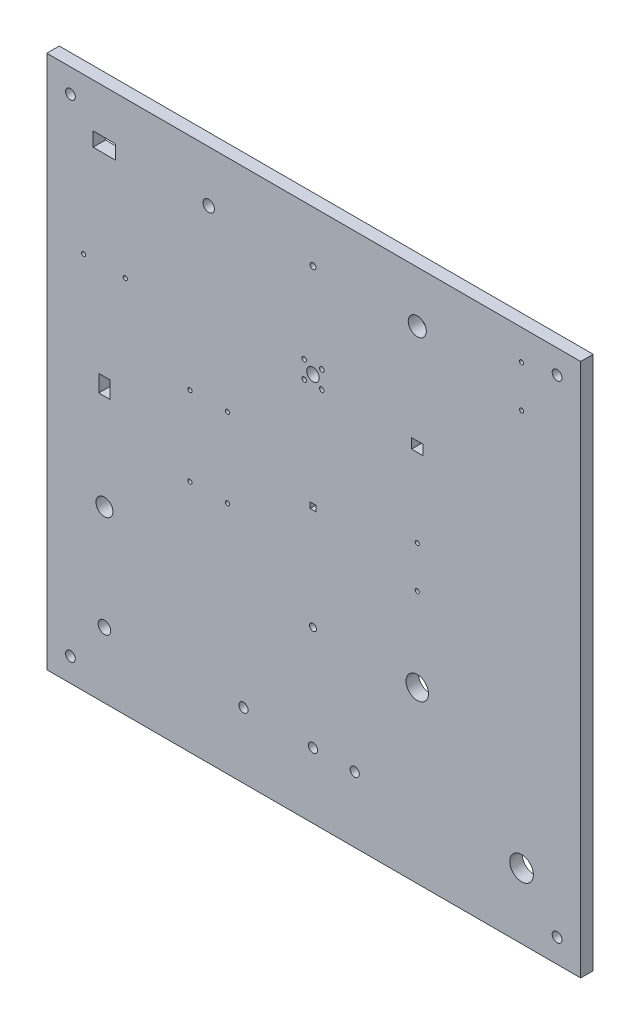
ISO-10303-21;
HEADER;
FILE_DESCRIPTION(('STEP AP214'),'2;1');
FILE_NAME('part.step','',(''),(''),'','','');
FILE_SCHEMA(('AUTOMOTIVE_DESIGN { 1 0 10303 214 1 1 1 1 }'));
ENDSEC;
DATA;
#1=APPLICATION_CONTEXT('core data for automotive mechanical design processes');
#2=APPLICATION_PROTOCOL_DEFINITION('international standard','automotive_design',2000,#1);
#3=PRODUCT_CONTEXT('',#1,'mechanical');
#4=PRODUCT('Part','Part','',(#3));
#5=PRODUCT_RELATED_PRODUCT_CATEGORY('part','',(#4));
#6=PRODUCT_DEFINITION_FORMATION('','',#4);
#7=PRODUCT_DEFINITION_CONTEXT('part definition',#1,'design');
#8=PRODUCT_DEFINITION('design','',#6,#7);
#9=PRODUCT_DEFINITION_SHAPE('','',#8);
#10=(LENGTH_UNIT() NAMED_UNIT(*) SI_UNIT(.MILLI.,.METRE.));
#11=(NAMED_UNIT(*) PLANE_ANGLE_UNIT() SI_UNIT($,.RADIAN.));
#12=(NAMED_UNIT(*) SI_UNIT($,.STERADIAN.) SOLID_ANGLE_UNIT());
#13=UNCERTAINTY_MEASURE_WITH_UNIT(LENGTH_MEASURE(1.E-05),#10,'distance_accuracy_value','');
#14=(GEOMETRIC_REPRESENTATION_CONTEXT(3) GLOBAL_UNCERTAINTY_ASSIGNED_CONTEXT((#13)) GLOBAL_UNIT_ASSIGNED_CONTEXT((#10,
#11,#12)) REPRESENTATION_CONTEXT('',''));
#15=CARTESIAN_POINT('',(0.,0.,0.));
#16=DIRECTION('',(0.,0.,1.));
#17=DIRECTION('',(1.,0.,0.));
#18=AXIS2_PLACEMENT_3D('',#15,#16,#17);
#19=CARTESIAN_POINT('',(0.,0.,4.4958));
#20=DIRECTION('',(0.,0.,1.));
#21=DIRECTION('',(1.,0.,0.));
#22=AXIS2_PLACEMENT_3D('',#19,#20,#21);
#23=PLANE('',#22);
#24=CARTESIAN_POINT('',(-174.449613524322,-180.175777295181,4.4958));
#25=DIRECTION('',(0.,0.,1.));
#26=DIRECTION('',(1.,0.,0.));
#27=AXIS2_PLACEMENT_3D('',#24,#25,#26);
#28=CIRCLE('',#27,3.5);
#29=CARTESIAN_POINT('',(-170.949613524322,-180.175777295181,4.4958));
#30=VERTEX_POINT('',#29);
#31=EDGE_CURVE('E231',#30,#30,#28,.T.);
#32=ORIENTED_EDGE('',*,*,#31,.F.);
#33=EDGE_LOOP('',(#32));
#34=FACE_BOUND('',#33,.T.);
#35=CARTESIAN_POINT('',(-174.449613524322,169.824222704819,4.4958));
#36=DIRECTION('',(0.,0.,1.));
#37=DIRECTION('',(1.,0.,0.));
#38=AXIS2_PLACEMENT_3D('',#35,#36,#37);
#39=CIRCLE('',#38,3.5);
#40=CARTESIAN_POINT('',(-170.949613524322,169.824222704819,4.4958));
#41=VERTEX_POINT('',#40);
#42=EDGE_CURVE('E240',#41,#41,#39,.T.);
#43=ORIENTED_EDGE('',*,*,#42,.F.);
#44=EDGE_LOOP('',(#43));
#45=FACE_BOUND('',#44,.T.);
#46=CARTESIAN_POINT('',(175.550386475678,169.824222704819,4.4958));
#47=DIRECTION('',(0.,0.,1.));
#48=DIRECTION('',(1.,0.,0.));
#49=AXIS2_PLACEMENT_3D('',#46,#47,#48);
#50=CIRCLE('',#49,3.5);
#51=CARTESIAN_POINT('',(179.050386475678,169.824222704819,4.4958));
#52=VERTEX_POINT('',#51);
#53=EDGE_CURVE('E246',#52,#52,#50,.T.);
#54=ORIENTED_EDGE('',*,*,#53,.F.);
#55=EDGE_LOOP('',(#54));
#56=FACE_BOUND('',#55,.T.);
#57=CARTESIAN_POINT('',(175.550386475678,-180.175777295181,4.4958));
#58=DIRECTION('',(0.,0.,1.));
#59=DIRECTION('',(1.,0.,0.));
#60=AXIS2_PLACEMENT_3D('',#57,#58,#59);
#61=CIRCLE('',#60,3.5);
#62=CARTESIAN_POINT('',(179.050386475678,-180.175777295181,4.4958));
#63=VERTEX_POINT('',#62);
#64=EDGE_CURVE('E252',#63,#63,#61,.T.);
#65=ORIENTED_EDGE('',*,*,#64,.F.);
#66=EDGE_LOOP('',(#65));
#67=FACE_BOUND('',#66,.T.);
#68=CARTESIAN_POINT('',(0.,-150.,4.4958));
#69=DIRECTION('',(0.,0.,1.));
#70=DIRECTION('',(1.,0.,0.));
#71=AXIS2_PLACEMENT_3D('',#68,#69,#70);
#72=CIRCLE('',#71,3.3);
#73=CARTESIAN_POINT('',(3.30000000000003,-150.,4.4958));
#74=VERTEX_POINT('',#73);
#75=EDGE_CURVE('E265',#74,#74,#72,.T.);
#76=ORIENTED_EDGE('',*,*,#75,.F.);
#77=EDGE_LOOP('',(#76));
#78=FACE_BOUND('',#77,.T.);
#79=CARTESIAN_POINT('',(0.,82.5,4.4958));
#80=DIRECTION('',(0.,0.,1.));
#81=DIRECTION('',(1.,0.,0.));
#82=AXIS2_PLACEMENT_3D('',#79,#80,#81);
#83=CIRCLE('',#82,4.50000000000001);
#84=CARTESIAN_POINT('',(4.50000000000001,82.5,4.4958));
#85=VERTEX_POINT('',#84);
#86=EDGE_CURVE('E277',#85,#85,#83,.T.);
#87=ORIENTED_EDGE('',*,*,#86,.F.);
#88=EDGE_LOOP('',(#87));
#89=FACE_BOUND('',#88,.T.);
#90=CARTESIAN_POINT('',(-6.3,76.2,4.4958));
#91=DIRECTION('',(0.,0.,1.));
#92=DIRECTION('',(1.,0.,0.));
#93=AXIS2_PLACEMENT_3D('',#90,#91,#92);
#94=CIRCLE('',#93,1.65000000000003);
#95=CARTESIAN_POINT('',(-4.64999999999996,76.2,4.4958));
#96=VERTEX_POINT('',#95);
#97=EDGE_CURVE('E289',#96,#96,#94,.T.);
#98=ORIENTED_EDGE('',*,*,#97,.F.);
#99=EDGE_LOOP('',(#98));
#100=FACE_BOUND('',#99,.T.);
#101=CARTESIAN_POINT('',(75.0000000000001,-15.,4.4958));
#102=DIRECTION('',(0.,0.,1.));
#103=DIRECTION('',(1.,0.,0.));
#104=AXIS2_PLACEMENT_3D('',#101,#102,#103);
#105=CIRCLE('',#104,1.5);
#106=CARTESIAN_POINT('',(76.5000000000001,-15.,4.4958));
#107=VERTEX_POINT('',#106);
#108=EDGE_CURVE('E301',#107,#107,#105,.T.);
#109=ORIENTED_EDGE('',*,*,#108,.F.);
#110=EDGE_LOOP('',(#109));
#111=FACE_BOUND('',#110,.T.);
#112=CARTESIAN_POINT('',(150.,135.,4.4958));
#113=DIRECTION('',(0.,0.,1.));
#114=DIRECTION('',(1.,0.,0.));
#115=AXIS2_PLACEMENT_3D('',#112,#113,#114);
#116=CIRCLE('',#115,1.5);
#117=CARTESIAN_POINT('',(151.5,135.,4.4958));
#118=VERTEX_POINT('',#117);
#119=EDGE_CURVE('E313',#118,#118,#116,.T.);
#120=ORIENTED_EDGE('',*,*,#119,.F.);
#121=EDGE_LOOP('',(#120));
#122=FACE_BOUND('',#121,.T.);
#123=CARTESIAN_POINT('',(-135.,75.,4.4958));
#124=DIRECTION('',(0.,0.,1.));
#125=DIRECTION('',(1.,0.,0.));
#126=AXIS2_PLACEMENT_3D('',#123,#124,#125);
#127=CIRCLE('',#126,1.49999999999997);
#128=CARTESIAN_POINT('',(-133.5,75.,4.4958));
#129=VERTEX_POINT('',#128);
#130=EDGE_CURVE('E325',#129,#129,#127,.T.);
#131=ORIENTED_EDGE('',*,*,#130,.F.);
#132=EDGE_LOOP('',(#131));
#133=FACE_BOUND('',#132,.T.);
#134=CARTESIAN_POINT('',(-150.,-75.,4.4958));
#135=DIRECTION('',(0.,0.,1.));
#136=DIRECTION('',(1.,0.,0.));
#137=AXIS2_PLACEMENT_3D('',#134,#135,#136);
#138=CIRCLE('',#137,6.09999999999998);
#139=CARTESIAN_POINT('',(-143.9,-75.,4.4958));
#140=VERTEX_POINT('',#139);
#141=EDGE_CURVE('E337',#140,#140,#138,.T.);
#142=ORIENTED_EDGE('',*,*,#141,.F.);
#143=EDGE_LOOP('',(#142));
#144=FACE_BOUND('',#143,.T.);
#145=DIRECTION('',(-0.00335828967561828,-0.999994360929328,0.));
#146=VECTOR('',#145,1.);
#147=CARTESIAN_POINT('',(-158.126110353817,144.948461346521,4.4958));
#148=LINE('',#147,#146);
#149=CARTESIAN_POINT('',(-158.091998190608,155.106004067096,4.4958));
#150=VERTEX_POINT('',#149);
#151=CARTESIAN_POINT('',(-158.126110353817,144.948461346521,4.4958));
#152=VERTEX_POINT('',#151);
#153=EDGE_CURVE('E351',#150,#152,#148,.T.);
#154=ORIENTED_EDGE('',*,*,#153,.F.);
#155=DIRECTION('',(-0.999994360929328,0.0033582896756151,0.));
#156=VECTOR('',#155,1.);
#157=CARTESIAN_POINT('',(-141.873889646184,155.051538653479,4.4958));
#158=LINE('',#157,#156);
#159=CARTESIAN_POINT('',(-141.873889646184,155.051538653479,4.4958));
#160=VERTEX_POINT('',#159);
#161=EDGE_CURVE('E349',#160,#150,#158,.T.);
#162=ORIENTED_EDGE('',*,*,#161,.F.);
#163=DIRECTION('',(0.00335828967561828,0.999994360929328,0.));
#164=VECTOR('',#163,1.);
#165=CARTESIAN_POINT('',(-141.908001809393,144.893995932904,4.4958));
#166=LINE('',#165,#164);
#167=CARTESIAN_POINT('',(-141.908001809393,144.893995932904,4.4958));
#168=VERTEX_POINT('',#167);
#169=EDGE_CURVE('E356',#168,#160,#166,.T.);
#170=ORIENTED_EDGE('',*,*,#169,.F.);
#171=DIRECTION('',(0.999994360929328,-0.0033582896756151,0.));
#172=VECTOR('',#171,1.);
#173=CARTESIAN_POINT('',(-141.908001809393,144.893995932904,4.4958));
#174=LINE('',#173,#172);
#175=EDGE_CURVE('E354',#152,#168,#174,.T.);
#176=ORIENTED_EDGE('',*,*,#175,.F.);
#177=EDGE_LOOP('',(#154,#162,#170,#176));
#178=FACE_BOUND('',#177,.T.);
#179=CARTESIAN_POINT('',(0.,150.,4.4958));
#180=DIRECTION('',(0.,0.,1.));
#181=DIRECTION('',(1.,0.,0.));
#182=AXIS2_PLACEMENT_3D('',#179,#180,#181);
#183=CIRCLE('',#182,2.1);
#184=CARTESIAN_POINT('',(2.09999999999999,150.,4.4958));
#185=VERTEX_POINT('',#184);
#186=EDGE_CURVE('E378',#185,#185,#183,.T.);
#187=ORIENTED_EDGE('',*,*,#186,.F.);
#188=EDGE_LOOP('',(#187));
#189=FACE_BOUND('',#188,.T.);
#190=CARTESIAN_POINT('',(-150.,-150.,4.4958));
#191=DIRECTION('',(0.,0.,1.));
#192=DIRECTION('',(1.,0.,0.));
#193=AXIS2_PLACEMENT_3D('',#190,#191,#192);
#194=CIRCLE('',#193,4.49999999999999);
#195=CARTESIAN_POINT('',(-145.5,-150.,4.4958));
#196=VERTEX_POINT('',#195);
#197=EDGE_CURVE('E421',#196,#196,#194,.T.);
#198=ORIENTED_EDGE('',*,*,#197,.F.);
#199=EDGE_LOOP('',(#198));
#200=FACE_BOUND('',#199,.T.);
#201=DIRECTION('',(-1.,0.,0.));
#202=VECTOR('',#201,1.);
#203=CARTESIAN_POINT('',(-2.055,2.055,4.4958));
#204=LINE('',#203,#202);
#205=CARTESIAN_POINT('',(2.055,2.055,4.4958));
#206=VERTEX_POINT('',#205);
#207=CARTESIAN_POINT('',(-2.055,2.055,4.4958));
#208=VERTEX_POINT('',#207);
#209=EDGE_CURVE('E435',#206,#208,#204,.T.);
#210=ORIENTED_EDGE('',*,*,#209,.F.);
#211=DIRECTION('',(0.,1.,0.));
#212=VECTOR('',#211,1.);
#213=CARTESIAN_POINT('',(2.055,-2.055,4.4958));
#214=LINE('',#213,#212);
#215=CARTESIAN_POINT('',(2.055,-2.055,4.4958));
#216=VERTEX_POINT('',#215);
#217=EDGE_CURVE('E433',#216,#206,#214,.T.);
#218=ORIENTED_EDGE('',*,*,#217,.F.);
#219=DIRECTION('',(1.,0.,0.));
#220=VECTOR('',#219,1.);
#221=CARTESIAN_POINT('',(-2.055,-2.055,4.4958));
#222=LINE('',#221,#220);
#223=CARTESIAN_POINT('',(-2.055,-2.055,4.4958));
#224=VERTEX_POINT('',#223);
#225=EDGE_CURVE('E441',#224,#216,#222,.T.);
#226=ORIENTED_EDGE('',*,*,#225,.F.);
#227=DIRECTION('',(0.,-1.,0.));
#228=VECTOR('',#227,1.);
#229=CARTESIAN_POINT('',(-2.055,-2.055,4.4958));
#230=LINE('',#229,#228);
#231=EDGE_CURVE('E438',#208,#224,#230,.T.);
#232=ORIENTED_EDGE('',*,*,#231,.F.);
#233=EDGE_LOOP('',(#210,#218,#226,#232));
#234=FACE_BOUND('',#233,.T.);
#235=CARTESIAN_POINT('',(-75.,150.,4.4958));
#236=DIRECTION('',(0.,0.,1.));
#237=DIRECTION('',(1.,0.,0.));
#238=AXIS2_PLACEMENT_3D('',#235,#236,#237);
#239=CIRCLE('',#238,4.1);
#240=CARTESIAN_POINT('',(-70.9,150.,4.4958));
#241=VERTEX_POINT('',#240);
#242=EDGE_CURVE('E464',#241,#241,#239,.T.);
#243=ORIENTED_EDGE('',*,*,#242,.F.);
#244=EDGE_LOOP('',(#243));
#245=FACE_BOUND('',#244,.T.);
#246=CARTESIAN_POINT('',(6.3,88.8,4.4958));
#247=DIRECTION('',(0.,0.,1.));
#248=DIRECTION('',(1.,0.,0.));
#249=AXIS2_PLACEMENT_3D('',#246,#247,#248);
#250=CIRCLE('',#249,1.65000000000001);
#251=CARTESIAN_POINT('',(7.95000000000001,88.8,4.4958));
#252=VERTEX_POINT('',#251);
#253=EDGE_CURVE('E507',#252,#252,#250,.T.);
#254=ORIENTED_EDGE('',*,*,#253,.F.);
#255=EDGE_LOOP('',(#254));
#256=FACE_BOUND('',#255,.T.);
#257=CARTESIAN_POINT('',(-61.5,28.5,4.4958));
#258=DIRECTION('',(0.,0.,1.));
#259=DIRECTION('',(1.,0.,0.));
#260=AXIS2_PLACEMENT_3D('',#257,#258,#259);
#261=CIRCLE('',#260,1.5);
#262=CARTESIAN_POINT('',(-60.,28.5,4.4958));
#263=VERTEX_POINT('',#262);
#264=EDGE_CURVE('E519',#263,#263,#261,.T.);
#265=ORIENTED_EDGE('',*,*,#264,.F.);
#266=EDGE_LOOP('',(#265));
#267=FACE_BOUND('',#266,.T.);
#268=CARTESIAN_POINT('',(-88.5,28.5,4.4958));
#269=DIRECTION('',(0.,0.,1.));
#270=DIRECTION('',(1.,0.,0.));
#271=AXIS2_PLACEMENT_3D('',#268,#269,#270);
#272=CIRCLE('',#271,1.49999999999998);
#273=CARTESIAN_POINT('',(-87.,28.5,4.4958));
#274=VERTEX_POINT('',#273);
#275=EDGE_CURVE('E531',#274,#274,#272,.T.);
#276=ORIENTED_EDGE('',*,*,#275,.F.);
#277=EDGE_LOOP('',(#276));
#278=FACE_BOUND('',#277,.T.);
#279=DIRECTION('',(0.,1.,0.));
#280=VECTOR('',#279,1.);
#281=CARTESIAN_POINT('',(192.550386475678,186.824222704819,4.4958));
#282=LINE('',#281,#280);
#283=CARTESIAN_POINT('',(192.550386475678,-197.175777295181,4.4958));
#284=VERTEX_POINT('',#283);
#285=CARTESIAN_POINT('',(192.550386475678,186.824222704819,4.4958));
#286=VERTEX_POINT('',#285);
#287=EDGE_CURVE('E537',#284,#286,#282,.T.);
#288=ORIENTED_EDGE('',*,*,#287,.T.);
#289=DIRECTION('',(-1.,0.,0.));
#290=VECTOR('',#289,1.);
#291=CARTESIAN_POINT('',(192.550386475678,186.824222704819,4.4958));
#292=LINE('',#291,#290);
#293=CARTESIAN_POINT('',(-191.449613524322,186.824222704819,4.4958));
#294=VERTEX_POINT('',#293);
#295=EDGE_CURVE('E540',#286,#294,#292,.T.);
#296=ORIENTED_EDGE('',*,*,#295,.T.);
#297=DIRECTION('',(0.,-1.,0.));
#298=VECTOR('',#297,1.);
#299=CARTESIAN_POINT('',(-191.449613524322,186.824222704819,4.4958));
#300=LINE('',#299,#298);
#301=CARTESIAN_POINT('',(-191.449613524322,-197.175777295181,4.4958));
#302=VERTEX_POINT('',#301);
#303=EDGE_CURVE('E543',#294,#302,#300,.T.);
#304=ORIENTED_EDGE('',*,*,#303,.T.);
#305=DIRECTION('',(1.,0.,0.));
#306=VECTOR('',#305,1.);
#307=CARTESIAN_POINT('',(-191.449613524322,-197.175777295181,4.4958));
#308=LINE('',#307,#306);
#309=EDGE_CURVE('E545',#302,#284,#308,.T.);
#310=ORIENTED_EDGE('',*,*,#309,.T.);
#311=EDGE_LOOP('',(#288,#296,#304,#310));
#312=FACE_BOUND('',#311,.T.);
#313=CARTESIAN_POINT('',(-88.5,-28.5,4.4958));
#314=DIRECTION('',(0.,0.,1.));
#315=DIRECTION('',(1.,0.,0.));
#316=AXIS2_PLACEMENT_3D('',#313,#314,#315);
#317=CIRCLE('',#316,1.5);
#318=CARTESIAN_POINT('',(-87.,-28.5,4.4958));
#319=VERTEX_POINT('',#318);
#320=EDGE_CURVE('E525',#319,#319,#317,.T.);
#321=ORIENTED_EDGE('',*,*,#320,.F.);
#322=EDGE_LOOP('',(#321));
#323=FACE_BOUND('',#322,.T.);
#324=CARTESIAN_POINT('',(-61.5,-28.5,4.4958));
#325=DIRECTION('',(0.,0.,1.));
#326=DIRECTION('',(1.,0.,0.));
#327=AXIS2_PLACEMENT_3D('',#324,#325,#326);
#328=CIRCLE('',#327,1.49999999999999);
#329=CARTESIAN_POINT('',(-60.,-28.5,4.4958));
#330=VERTEX_POINT('',#329);
#331=EDGE_CURVE('E513',#330,#330,#328,.T.);
#332=ORIENTED_EDGE('',*,*,#331,.F.);
#333=EDGE_LOOP('',(#332));
#334=FACE_BOUND('',#333,.T.);
#335=CARTESIAN_POINT('',(150.,-150.,4.4958));
#336=DIRECTION('',(0.,0.,1.));
#337=DIRECTION('',(1.,0.,0.));
#338=AXIS2_PLACEMENT_3D('',#335,#336,#337);
#339=CIRCLE('',#338,8.50000000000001);
#340=CARTESIAN_POINT('',(158.5,-150.,4.4958));
#341=VERTEX_POINT('',#340);
#342=EDGE_CURVE('E501',#341,#341,#339,.T.);
#343=ORIENTED_EDGE('',*,*,#342,.F.);
#344=EDGE_LOOP('',(#343));
#345=FACE_BOUND('',#344,.T.);
#346=DIRECTION('',(-1.,0.,0.));
#347=VECTOR('',#346,1.);
#348=CARTESIAN_POINT('',(-154.0687,6.0889,4.4958));
#349=LINE('',#348,#347);
#350=CARTESIAN_POINT('',(-145.9313,6.0889,4.4958));
#351=VERTEX_POINT('',#350);
#352=CARTESIAN_POINT('',(-154.0687,6.0889,4.4958));
#353=VERTEX_POINT('',#352);
#354=EDGE_CURVE('E472',#351,#353,#349,.T.);
#355=ORIENTED_EDGE('',*,*,#354,.F.);
#356=DIRECTION('',(0.,1.,0.));
#357=VECTOR('',#356,1.);
#358=CARTESIAN_POINT('',(-145.9313,-6.0889,4.4958));
#359=LINE('',#358,#357);
#360=CARTESIAN_POINT('',(-145.9313,-6.0889,4.4958));
#361=VERTEX_POINT('',#360);
#362=EDGE_CURVE('E470',#361,#351,#359,.T.);
#363=ORIENTED_EDGE('',*,*,#362,.F.);
#364=DIRECTION('',(1.,0.,0.));
#365=VECTOR('',#364,1.);
#366=CARTESIAN_POINT('',(-154.0687,-6.0889,4.4958));
#367=LINE('',#366,#365);
#368=CARTESIAN_POINT('',(-154.0687,-6.0889,4.4958));
#369=VERTEX_POINT('',#368);
#370=EDGE_CURVE('E478',#369,#361,#367,.T.);
#371=ORIENTED_EDGE('',*,*,#370,.F.);
#372=DIRECTION('',(0.,-1.,0.));
#373=VECTOR('',#372,1.);
#374=CARTESIAN_POINT('',(-154.0687,-6.0889,4.4958));
#375=LINE('',#374,#373);
#376=EDGE_CURVE('E475',#353,#369,#375,.T.);
#377=ORIENTED_EDGE('',*,*,#376,.F.);
#378=EDGE_LOOP('',(#355,#363,#371,#377));
#379=FACE_BOUND('',#378,.T.);
#380=CARTESIAN_POINT('',(75.,-75.,4.4958));
#381=DIRECTION('',(0.,0.,1.));
#382=DIRECTION('',(1.,0.,0.));
#383=AXIS2_PLACEMENT_3D('',#380,#381,#382);
#384=CIRCLE('',#383,8.09999999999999);
#385=CARTESIAN_POINT('',(83.1,-75.,4.4958));
#386=VERTEX_POINT('',#385);
#387=EDGE_CURVE('E427',#386,#386,#384,.T.);
#388=ORIENTED_EDGE('',*,*,#387,.F.);
#389=EDGE_LOOP('',(#388));
#390=FACE_BOUND('',#389,.T.);
#391=CARTESIAN_POINT('',(75.,150.,4.4958));
#392=DIRECTION('',(0.,0.,1.));
#393=DIRECTION('',(1.,0.,0.));
#394=AXIS2_PLACEMENT_3D('',#391,#392,#393);
#395=CIRCLE('',#394,6.5);
#396=CARTESIAN_POINT('',(81.5,150.,4.4958));
#397=VERTEX_POINT('',#396);
#398=EDGE_CURVE('E415',#397,#397,#395,.T.);
#399=ORIENTED_EDGE('',*,*,#398,.F.);
#400=EDGE_LOOP('',(#399));
#401=FACE_BOUND('',#400,.T.);
#402=DIRECTION('',(-0.00176999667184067,-0.999998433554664,0.));
#403=VECTOR('',#402,1.);
#404=CARTESIAN_POINT('',(70.9214928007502,71.4402133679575,4.4958));
#405=LINE('',#404,#403);
#406=CARTESIAN_POINT('',(70.9341199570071,78.5742021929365,4.4958));
#407=VERTEX_POINT('',#406);
#408=CARTESIAN_POINT('',(70.9214928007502,71.4402133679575,4.4958));
#409=VERTEX_POINT('',#408);
#410=EDGE_CURVE('E386',#407,#409,#405,.T.);
#411=ORIENTED_EDGE('',*,*,#410,.F.);
#412=DIRECTION('',(-0.999998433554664,0.00176999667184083,0.));
#413=VECTOR('',#412,1.);
#414=CARTESIAN_POINT('',(79.0785071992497,78.5597866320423,4.4958));
#415=LINE('',#414,#413);
#416=CARTESIAN_POINT('',(79.0785071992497,78.5597866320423,4.4958));
#417=VERTEX_POINT('',#416);
#418=EDGE_CURVE('E384',#417,#407,#415,.T.);
#419=ORIENTED_EDGE('',*,*,#418,.F.);
#420=DIRECTION('',(0.00176999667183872,0.999998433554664,0.));
#421=VECTOR('',#420,1.);
#422=CARTESIAN_POINT('',(79.0658800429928,71.4257978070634,4.4958));
#423=LINE('',#422,#421);
#424=CARTESIAN_POINT('',(79.0658800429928,71.4257978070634,4.4958));
#425=VERTEX_POINT('',#424);
#426=EDGE_CURVE('E392',#425,#417,#423,.T.);
#427=ORIENTED_EDGE('',*,*,#426,.F.);
#428=DIRECTION('',(0.999998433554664,-0.00176999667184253,0.));
#429=VECTOR('',#428,1.);
#430=CARTESIAN_POINT('',(79.0658800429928,71.4257978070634,4.4958));
#431=LINE('',#430,#429);
#432=EDGE_CURVE('E389',#409,#425,#431,.T.);
#433=ORIENTED_EDGE('',*,*,#432,.F.);
#434=EDGE_LOOP('',(#411,#419,#427,#433));
#435=FACE_BOUND('',#434,.T.);
#436=CARTESIAN_POINT('',(0.,-75.,4.4958));
#437=DIRECTION('',(0.,0.,1.));
#438=DIRECTION('',(1.,0.,0.));
#439=AXIS2_PLACEMENT_3D('',#436,#437,#438);
#440=CIRCLE('',#439,2.5);
#441=CARTESIAN_POINT('',(2.50000000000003,-75.,4.4958));
#442=VERTEX_POINT('',#441);
#443=EDGE_CURVE('E343',#442,#442,#440,.T.);
#444=ORIENTED_EDGE('',*,*,#443,.F.);
#445=EDGE_LOOP('',(#444));
#446=FACE_BOUND('',#445,.T.);
#447=CARTESIAN_POINT('',(-165.,75.,4.4958));
#448=DIRECTION('',(0.,0.,1.));
#449=DIRECTION('',(1.,0.,0.));
#450=AXIS2_PLACEMENT_3D('',#447,#448,#449);
#451=CIRCLE('',#450,1.5);
#452=CARTESIAN_POINT('',(-163.5,75.,4.4958));
#453=VERTEX_POINT('',#452);
#454=EDGE_CURVE('E331',#453,#453,#451,.T.);
#455=ORIENTED_EDGE('',*,*,#454,.F.);
#456=EDGE_LOOP('',(#455));
#457=FACE_BOUND('',#456,.T.);
#458=CARTESIAN_POINT('',(150.,165.,4.4958));
#459=DIRECTION('',(0.,0.,1.));
#460=DIRECTION('',(1.,0.,0.));
#461=AXIS2_PLACEMENT_3D('',#458,#459,#460);
#462=CIRCLE('',#461,1.5);
#463=CARTESIAN_POINT('',(151.5,165.,4.4958));
#464=VERTEX_POINT('',#463);
#465=EDGE_CURVE('E319',#464,#464,#462,.T.);
#466=ORIENTED_EDGE('',*,*,#465,.F.);
#467=EDGE_LOOP('',(#466));
#468=FACE_BOUND('',#467,.T.);
#469=CARTESIAN_POINT('',(75.0000000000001,15.,4.4958));
#470=DIRECTION('',(0.,0.,1.));
#471=DIRECTION('',(1.,0.,0.));
#472=AXIS2_PLACEMENT_3D('',#469,#470,#471);
#473=CIRCLE('',#472,1.5);
#474=CARTESIAN_POINT('',(76.5000000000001,15.,4.4958));
#475=VERTEX_POINT('',#474);
#476=EDGE_CURVE('E307',#475,#475,#473,.T.);
#477=ORIENTED_EDGE('',*,*,#476,.F.);
#478=EDGE_LOOP('',(#477));
#479=FACE_BOUND('',#478,.T.);
#480=CARTESIAN_POINT('',(6.3,76.2,4.4958));
#481=DIRECTION('',(0.,0.,1.));
#482=DIRECTION('',(1.,0.,0.));
#483=AXIS2_PLACEMENT_3D('',#480,#481,#482);
#484=CIRCLE('',#483,1.65000000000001);
#485=CARTESIAN_POINT('',(7.95000000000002,76.2,4.4958));
#486=VERTEX_POINT('',#485);
#487=EDGE_CURVE('E295',#486,#486,#484,.T.);
#488=ORIENTED_EDGE('',*,*,#487,.F.);
#489=EDGE_LOOP('',(#488));
#490=FACE_BOUND('',#489,.T.);
#491=CARTESIAN_POINT('',(-6.3,88.8,4.4958));
#492=DIRECTION('',(0.,0.,1.));
#493=DIRECTION('',(1.,0.,0.));
#494=AXIS2_PLACEMENT_3D('',#491,#492,#493);
#495=CIRCLE('',#494,1.65000000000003);
#496=CARTESIAN_POINT('',(-4.64999999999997,88.8,4.4958));
#497=VERTEX_POINT('',#496);
#498=EDGE_CURVE('E283',#497,#497,#495,.T.);
#499=ORIENTED_EDGE('',*,*,#498,.F.);
#500=EDGE_LOOP('',(#499));
#501=FACE_BOUND('',#500,.T.);
#502=CARTESIAN_POINT('',(-50.,-150.,4.4958));
#503=DIRECTION('',(0.,0.,1.));
#504=DIRECTION('',(1.,0.,0.));
#505=AXIS2_PLACEMENT_3D('',#502,#503,#504);
#506=CIRCLE('',#505,3.3);
#507=CARTESIAN_POINT('',(-46.7,-150.,4.4958));
#508=VERTEX_POINT('',#507);
#509=EDGE_CURVE('E271',#508,#508,#506,.T.);
#510=ORIENTED_EDGE('',*,*,#509,.F.);
#511=EDGE_LOOP('',(#510));
#512=FACE_BOUND('',#511,.T.);
#513=CARTESIAN_POINT('',(30.,-150.,4.4958));
#514=DIRECTION('',(0.,0.,1.));
#515=DIRECTION('',(1.,0.,0.));
#516=AXIS2_PLACEMENT_3D('',#513,#514,#515);
#517=CIRCLE('',#516,3.3);
#518=CARTESIAN_POINT('',(33.3,-150.,4.4958));
#519=VERTEX_POINT('',#518);
#520=EDGE_CURVE('E259',#519,#519,#517,.T.);
#521=ORIENTED_EDGE('',*,*,#520,.F.);
#522=EDGE_LOOP('',(#521));
#523=FACE_BOUND('',#522,.T.);
#524=ADVANCED_FACE('F35',(#34,#45,#56,#67,#78,#89,#100,#111,#122,#133,#144,#178,#189,#200,#234,
#245,#256,#267,#278,#312,#323,#334,#345,#379,#390,#401,#435,#446,#457,#468,#479,#490,#501,#512,
#523),#23,.T.);
#525=CARTESIAN_POINT('',(0.,0.,-4.4958));
#526=DIRECTION('',(0.,0.,1.));
#527=DIRECTION('',(1.,0.,0.));
#528=AXIS2_PLACEMENT_3D('',#525,#526,#527);
#529=PLANE('',#528);
#530=DIRECTION('',(-1.,0.,0.));
#531=VECTOR('',#530,1.);
#532=CARTESIAN_POINT('',(184.550386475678,-45.1757772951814,-4.4958));
#533=LINE('',#532,#531);
#534=CARTESIAN_POINT('',(184.550386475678,-45.1757772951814,-4.4958));
#535=VERTEX_POINT('',#534);
#536=CARTESIAN_POINT('',(104.550386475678,-45.1757772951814,-4.4958));
#537=VERTEX_POINT('',#536);
#538=EDGE_CURVE('E225',#535,#537,#533,.T.);
#539=ORIENTED_EDGE('',*,*,#538,.F.);
#540=DIRECTION('',(0.,-1.,0.));
#541=VECTOR('',#540,1.);
#542=CARTESIAN_POINT('',(184.550386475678,34.8242227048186,-4.4958));
#543=LINE('',#542,#541);
#544=CARTESIAN_POINT('',(184.550386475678,34.8242227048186,-4.4958));
#545=VERTEX_POINT('',#544);
#546=EDGE_CURVE('E50',#545,#535,#543,.T.);
#547=ORIENTED_EDGE('',*,*,#546,.F.);
#548=DIRECTION('',(1.,0.,0.));
#549=VECTOR('',#548,1.);
#550=CARTESIAN_POINT('',(184.550386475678,34.8242227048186,-4.4958));
#551=LINE('',#550,#549);
#552=CARTESIAN_POINT('',(104.550386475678,34.8242227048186,-4.4958));
#553=VERTEX_POINT('',#552);
#554=EDGE_CURVE('E216',#553,#545,#551,.T.);
#555=ORIENTED_EDGE('',*,*,#554,.F.);
#556=DIRECTION('',(0.,1.,0.));
#557=VECTOR('',#556,1.);
#558=CARTESIAN_POINT('',(104.550386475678,34.8242227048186,-4.4958));
#559=LINE('',#558,#557);
#560=EDGE_CURVE('E219',#537,#553,#559,.T.);
#561=ORIENTED_EDGE('',*,*,#560,.F.);
#562=EDGE_LOOP('',(#539,#547,#555,#561));
#563=FACE_BOUND('',#562,.T.);
#564=CARTESIAN_POINT('',(-174.449613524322,-180.175777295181,-4.4958));
#565=DIRECTION('',(0.,0.,1.));
#566=DIRECTION('',(1.,0.,0.));
#567=AXIS2_PLACEMENT_3D('',#564,#565,#566);
#568=CIRCLE('',#567,3.5);
#569=CARTESIAN_POINT('',(-170.949613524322,-180.175777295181,-4.4958));
#570=VERTEX_POINT('',#569);
#571=EDGE_CURVE('E237',#570,#570,#568,.T.);
#572=ORIENTED_EDGE('',*,*,#571,.T.);
#573=EDGE_LOOP('',(#572));
#574=FACE_BOUND('',#573,.T.);
#575=CARTESIAN_POINT('',(-174.449613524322,169.824222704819,-4.4958));
#576=DIRECTION('',(0.,0.,1.));
#577=DIRECTION('',(1.,0.,0.));
#578=AXIS2_PLACEMENT_3D('',#575,#576,#577);
#579=CIRCLE('',#578,3.5);
#580=CARTESIAN_POINT('',(-170.949613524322,169.824222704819,-4.4958));
#581=VERTEX_POINT('',#580);
#582=EDGE_CURVE('E243',#581,#581,#579,.T.);
#583=ORIENTED_EDGE('',*,*,#582,.T.);
#584=EDGE_LOOP('',(#583));
#585=FACE_BOUND('',#584,.T.);
#586=CARTESIAN_POINT('',(175.550386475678,169.824222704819,-4.4958));
#587=DIRECTION('',(0.,0.,1.));
#588=DIRECTION('',(1.,0.,0.));
#589=AXIS2_PLACEMENT_3D('',#586,#587,#588);
#590=CIRCLE('',#589,3.5);
#591=CARTESIAN_POINT('',(179.050386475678,169.824222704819,-4.4958));
#592=VERTEX_POINT('',#591);
#593=EDGE_CURVE('E249',#592,#592,#590,.T.);
#594=ORIENTED_EDGE('',*,*,#593,.T.);
#595=EDGE_LOOP('',(#594));
#596=FACE_BOUND('',#595,.T.);
#597=CARTESIAN_POINT('',(175.550386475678,-180.175777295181,-4.4958));
#598=DIRECTION('',(0.,0.,1.));
#599=DIRECTION('',(1.,0.,0.));
#600=AXIS2_PLACEMENT_3D('',#597,#598,#599);
#601=CIRCLE('',#600,3.5);
#602=CARTESIAN_POINT('',(179.050386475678,-180.175777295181,-4.4958));
#603=VERTEX_POINT('',#602);
#604=EDGE_CURVE('E255',#603,#603,#601,.T.);
#605=ORIENTED_EDGE('',*,*,#604,.T.);
#606=EDGE_LOOP('',(#605));
#607=FACE_BOUND('',#606,.T.);
#608=CARTESIAN_POINT('',(0.,150.,-4.4958));
#609=DIRECTION('',(0.,0.,1.));
#610=DIRECTION('',(1.,0.,0.));
#611=AXIS2_PLACEMENT_3D('',#608,#609,#610);
#612=CIRCLE('',#611,2.1);
#613=CARTESIAN_POINT('',(2.09999999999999,150.,-4.4958));
#614=VERTEX_POINT('',#613);
#615=EDGE_CURVE('E377',#614,#614,#612,.T.);
#616=ORIENTED_EDGE('',*,*,#615,.T.);
#617=EDGE_LOOP('',(#616));
#618=FACE_BOUND('',#617,.T.);
#619=DIRECTION('',(-0.999998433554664,0.00176999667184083,0.));
#620=VECTOR('',#619,1.);
#621=CARTESIAN_POINT('',(79.0785071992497,78.5597866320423,-4.4958));
#622=LINE('',#621,#620);
#623=CARTESIAN_POINT('',(79.0785071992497,78.5597866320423,-4.4958));
#624=VERTEX_POINT('',#623);
#625=CARTESIAN_POINT('',(70.9341199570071,78.5742021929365,-4.4958));
#626=VERTEX_POINT('',#625);
#627=EDGE_CURVE('E381',#624,#626,#622,.T.);
#628=ORIENTED_EDGE('',*,*,#627,.T.);
#629=DIRECTION('',(-0.00176999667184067,-0.999998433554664,0.));
#630=VECTOR('',#629,1.);
#631=CARTESIAN_POINT('',(70.9214928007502,71.4402133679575,-4.4958));
#632=LINE('',#631,#630);
#633=CARTESIAN_POINT('',(70.9214928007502,71.4402133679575,-4.4958));
#634=VERTEX_POINT('',#633);
#635=EDGE_CURVE('E397',#626,#634,#632,.T.);
#636=ORIENTED_EDGE('',*,*,#635,.T.);
#637=DIRECTION('',(0.999998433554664,-0.00176999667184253,0.));
#638=VECTOR('',#637,1.);
#639=CARTESIAN_POINT('',(79.0658800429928,71.4257978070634,-4.4958));
#640=LINE('',#639,#638);
#641=CARTESIAN_POINT('',(79.0658800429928,71.4257978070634,-4.4958));
#642=VERTEX_POINT('',#641);
#643=EDGE_CURVE('E400',#634,#642,#640,.T.);
#644=ORIENTED_EDGE('',*,*,#643,.T.);
#645=DIRECTION('',(0.00176999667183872,0.999998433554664,0.));
#646=VECTOR('',#645,1.);
#647=CARTESIAN_POINT('',(79.0658800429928,71.4257978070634,-4.4958));
#648=LINE('',#647,#646);
#649=EDGE_CURVE('E387',#642,#624,#648,.T.);
#650=ORIENTED_EDGE('',*,*,#649,.T.);
#651=EDGE_LOOP('',(#628,#636,#644,#650));
#652=FACE_BOUND('',#651,.T.);
#653=CARTESIAN_POINT('',(-75.,150.,-4.4958));
#654=DIRECTION('',(0.,0.,1.));
#655=DIRECTION('',(1.,0.,0.));
#656=AXIS2_PLACEMENT_3D('',#653,#654,#655);
#657=CIRCLE('',#656,4.1);
#658=CARTESIAN_POINT('',(-70.9,150.,-4.4958));
#659=VERTEX_POINT('',#658);
#660=EDGE_CURVE('E463',#659,#659,#657,.T.);
#661=ORIENTED_EDGE('',*,*,#660,.T.);
#662=EDGE_LOOP('',(#661));
#663=FACE_BOUND('',#662,.T.);
#664=DIRECTION('',(0.,1.,0.));
#665=VECTOR('',#664,1.);
#666=CARTESIAN_POINT('',(-145.9313,-6.0889,-4.4958));
#667=LINE('',#666,#665);
#668=CARTESIAN_POINT('',(-145.9313,-6.0889,-4.4958));
#669=VERTEX_POINT('',#668);
#670=CARTESIAN_POINT('',(-145.9313,6.0889,-4.4958));
#671=VERTEX_POINT('',#670);
#672=EDGE_CURVE('E467',#669,#671,#667,.T.);
#673=ORIENTED_EDGE('',*,*,#672,.T.);
#674=DIRECTION('',(-1.,0.,0.));
#675=VECTOR('',#674,1.);
#676=CARTESIAN_POINT('',(-154.0687,6.0889,-4.4958));
#677=LINE('',#676,#675);
#678=CARTESIAN_POINT('',(-154.0687,6.0889,-4.4958));
#679=VERTEX_POINT('',#678);
#680=EDGE_CURVE('E483',#671,#679,#677,.T.);
#681=ORIENTED_EDGE('',*,*,#680,.T.);
#682=DIRECTION('',(0.,-1.,0.));
#683=VECTOR('',#682,1.);
#684=CARTESIAN_POINT('',(-154.0687,-6.0889,-4.4958));
#685=LINE('',#684,#683);
#686=CARTESIAN_POINT('',(-154.0687,-6.0889,-4.4958));
#687=VERTEX_POINT('',#686);
#688=EDGE_CURVE('E486',#679,#687,#685,.T.);
#689=ORIENTED_EDGE('',*,*,#688,.T.);
#690=DIRECTION('',(1.,0.,0.));
#691=VECTOR('',#690,1.);
#692=CARTESIAN_POINT('',(-154.0687,-6.0889,-4.4958));
#693=LINE('',#692,#691);
#694=EDGE_CURVE('E473',#687,#669,#693,.T.);
#695=ORIENTED_EDGE('',*,*,#694,.T.);
#696=EDGE_LOOP('',(#673,#681,#689,#695));
#697=FACE_BOUND('',#696,.T.);
#698=DIRECTION('',(0.,1.,0.));
#699=VECTOR('',#698,1.);
#700=CARTESIAN_POINT('',(192.550386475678,186.824222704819,-4.4958));
#701=LINE('',#700,#699);
#702=CARTESIAN_POINT('',(192.550386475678,-197.175777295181,-4.4958));
#703=VERTEX_POINT('',#702);
#704=CARTESIAN_POINT('',(192.550386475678,186.824222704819,-4.4958));
#705=VERTEX_POINT('',#704);
#706=EDGE_CURVE('E534',#703,#705,#701,.T.);
#707=ORIENTED_EDGE('',*,*,#706,.F.);
#708=DIRECTION('',(1.,0.,0.));
#709=VECTOR('',#708,1.);
#710=CARTESIAN_POINT('',(-191.449613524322,-197.175777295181,-4.4958));
#711=LINE('',#710,#709);
#712=CARTESIAN_POINT('',(-191.449613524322,-197.175777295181,-4.4958));
#713=VERTEX_POINT('',#712);
#714=EDGE_CURVE('E541',#713,#703,#711,.T.);
#715=ORIENTED_EDGE('',*,*,#714,.F.);
#716=DIRECTION('',(0.,-1.,0.));
#717=VECTOR('',#716,1.);
#718=CARTESIAN_POINT('',(-191.449613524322,186.824222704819,-4.4958));
#719=LINE('',#718,#717);
#720=CARTESIAN_POINT('',(-191.449613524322,186.824222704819,-4.4958));
#721=VERTEX_POINT('',#720);
#722=EDGE_CURVE('E552',#721,#713,#719,.T.);
#723=ORIENTED_EDGE('',*,*,#722,.F.);
#724=DIRECTION('',(-1.,0.,0.));
#725=VECTOR('',#724,1.);
#726=CARTESIAN_POINT('',(192.550386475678,186.824222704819,-4.4958));
#727=LINE('',#726,#725);
#728=EDGE_CURVE('E550',#705,#721,#727,.T.);
#729=ORIENTED_EDGE('',*,*,#728,.F.);
#730=EDGE_LOOP('',(#707,#715,#723,#729));
#731=FACE_BOUND('',#730,.T.);
#732=CARTESIAN_POINT('',(-88.5,28.5,-4.4958));
#733=DIRECTION('',(0.,0.,1.));
#734=DIRECTION('',(1.,0.,0.));
#735=AXIS2_PLACEMENT_3D('',#732,#733,#734);
#736=CIRCLE('',#735,1.49999999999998);
#737=CARTESIAN_POINT('',(-87.,28.5,-4.4958));
#738=VERTEX_POINT('',#737);
#739=EDGE_CURVE('E528',#738,#738,#736,.T.);
#740=ORIENTED_EDGE('',*,*,#739,.T.);
#741=EDGE_LOOP('',(#740));
#742=FACE_BOUND('',#741,.T.);
#743=CARTESIAN_POINT('',(-88.5,-28.5,-4.4958));
#744=DIRECTION('',(0.,0.,1.));
#745=DIRECTION('',(1.,0.,0.));
#746=AXIS2_PLACEMENT_3D('',#743,#744,#745);
#747=CIRCLE('',#746,1.5);
#748=CARTESIAN_POINT('',(-87.,-28.5,-4.4958));
#749=VERTEX_POINT('',#748);
#750=EDGE_CURVE('E522',#749,#749,#747,.T.);
#751=ORIENTED_EDGE('',*,*,#750,.T.);
#752=EDGE_LOOP('',(#751));
#753=FACE_BOUND('',#752,.T.);
#754=CARTESIAN_POINT('',(-61.5,28.5,-4.4958));
#755=DIRECTION('',(0.,0.,1.));
#756=DIRECTION('',(1.,0.,0.));
#757=AXIS2_PLACEMENT_3D('',#754,#755,#756);
#758=CIRCLE('',#757,1.5);
#759=CARTESIAN_POINT('',(-60.,28.5,-4.4958));
#760=VERTEX_POINT('',#759);
#761=EDGE_CURVE('E516',#760,#760,#758,.T.);
#762=ORIENTED_EDGE('',*,*,#761,.T.);
#763=EDGE_LOOP('',(#762));
#764=FACE_BOUND('',#763,.T.);
#765=CARTESIAN_POINT('',(-61.5,-28.5,-4.4958));
#766=DIRECTION('',(0.,0.,1.));
#767=DIRECTION('',(1.,0.,0.));
#768=AXIS2_PLACEMENT_3D('',#765,#766,#767);
#769=CIRCLE('',#768,1.49999999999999);
#770=CARTESIAN_POINT('',(-60.,-28.5,-4.4958));
#771=VERTEX_POINT('',#770);
#772=EDGE_CURVE('E510',#771,#771,#769,.T.);
#773=ORIENTED_EDGE('',*,*,#772,.T.);
#774=EDGE_LOOP('',(#773));
#775=FACE_BOUND('',#774,.T.);
#776=CARTESIAN_POINT('',(6.3,88.8,-4.4958));
#777=DIRECTION('',(0.,0.,1.));
#778=DIRECTION('',(1.,0.,0.));
#779=AXIS2_PLACEMENT_3D('',#776,#777,#778);
#780=CIRCLE('',#779,1.65000000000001);
#781=CARTESIAN_POINT('',(7.95000000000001,88.8,-4.4958));
#782=VERTEX_POINT('',#781);
#783=EDGE_CURVE('E504',#782,#782,#780,.T.);
#784=ORIENTED_EDGE('',*,*,#783,.T.);
#785=EDGE_LOOP('',(#784));
#786=FACE_BOUND('',#785,.T.);
#787=CARTESIAN_POINT('',(150.,-150.,-4.4958));
#788=DIRECTION('',(0.,0.,1.));
#789=DIRECTION('',(1.,0.,0.));
#790=AXIS2_PLACEMENT_3D('',#787,#788,#789);
#791=CIRCLE('',#790,8.50000000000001);
#792=CARTESIAN_POINT('',(158.5,-150.,-4.4958));
#793=VERTEX_POINT('',#792);
#794=EDGE_CURVE('E500',#793,#793,#791,.T.);
#795=ORIENTED_EDGE('',*,*,#794,.T.);
#796=EDGE_LOOP('',(#795));
#797=FACE_BOUND('',#796,.T.);
#798=DIRECTION('',(0.,1.,0.));
#799=VECTOR('',#798,1.);
#800=CARTESIAN_POINT('',(2.055,-2.055,-4.4958));
#801=LINE('',#800,#799);
#802=CARTESIAN_POINT('',(2.055,-2.055,-4.4958));
#803=VERTEX_POINT('',#802);
#804=CARTESIAN_POINT('',(2.055,2.055,-4.4958));
#805=VERTEX_POINT('',#804);
#806=EDGE_CURVE('E430',#803,#805,#801,.T.);
#807=ORIENTED_EDGE('',*,*,#806,.T.);
#808=DIRECTION('',(-1.,0.,0.));
#809=VECTOR('',#808,1.);
#810=CARTESIAN_POINT('',(-2.055,2.055,-4.4958));
#811=LINE('',#810,#809);
#812=CARTESIAN_POINT('',(-2.055,2.055,-4.4958));
#813=VERTEX_POINT('',#812);
#814=EDGE_CURVE('E446',#805,#813,#811,.T.);
#815=ORIENTED_EDGE('',*,*,#814,.T.);
#816=DIRECTION('',(0.,-1.,0.));
#817=VECTOR('',#816,1.);
#818=CARTESIAN_POINT('',(-2.055,-2.055,-4.4958));
#819=LINE('',#818,#817);
#820=CARTESIAN_POINT('',(-2.055,-2.055,-4.4958));
#821=VERTEX_POINT('',#820);
#822=EDGE_CURVE('E449',#813,#821,#819,.T.);
#823=ORIENTED_EDGE('',*,*,#822,.T.);
#824=DIRECTION('',(1.,0.,0.));
#825=VECTOR('',#824,1.);
#826=CARTESIAN_POINT('',(-2.055,-2.055,-4.4958));
#827=LINE('',#826,#825);
#828=EDGE_CURVE('E436',#821,#803,#827,.T.);
#829=ORIENTED_EDGE('',*,*,#828,.T.);
#830=EDGE_LOOP('',(#807,#815,#823,#829));
#831=FACE_BOUND('',#830,.T.);
#832=CARTESIAN_POINT('',(75.,-75.,-4.4958));
#833=DIRECTION('',(0.,0.,1.));
#834=DIRECTION('',(1.,0.,0.));
#835=AXIS2_PLACEMENT_3D('',#832,#833,#834);
#836=CIRCLE('',#835,8.09999999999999);
#837=CARTESIAN_POINT('',(83.1,-75.,-4.4958));
#838=VERTEX_POINT('',#837);
#839=EDGE_CURVE('E424',#838,#838,#836,.T.);
#840=ORIENTED_EDGE('',*,*,#839,.T.);
#841=EDGE_LOOP('',(#840));
#842=FACE_BOUND('',#841,.T.);
#843=CARTESIAN_POINT('',(-150.,-150.,-4.4958));
#844=DIRECTION('',(0.,0.,1.));
#845=DIRECTION('',(1.,0.,0.));
#846=AXIS2_PLACEMENT_3D('',#843,#844,#845);
#847=CIRCLE('',#846,4.49999999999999);
#848=CARTESIAN_POINT('',(-145.5,-150.,-4.4958));
#849=VERTEX_POINT('',#848);
#850=EDGE_CURVE('E418',#849,#849,#847,.T.);
#851=ORIENTED_EDGE('',*,*,#850,.T.);
#852=EDGE_LOOP('',(#851));
#853=FACE_BOUND('',#852,.T.);
#854=CARTESIAN_POINT('',(75.,150.,-4.4958));
#855=DIRECTION('',(0.,0.,1.));
#856=DIRECTION('',(1.,0.,0.));
#857=AXIS2_PLACEMENT_3D('',#854,#855,#856);
#858=CIRCLE('',#857,6.5);
#859=CARTESIAN_POINT('',(81.5,150.,-4.4958));
#860=VERTEX_POINT('',#859);
#861=EDGE_CURVE('E414',#860,#860,#858,.T.);
#862=ORIENTED_EDGE('',*,*,#861,.T.);
#863=EDGE_LOOP('',(#862));
#864=FACE_BOUND('',#863,.T.);
#865=DIRECTION('',(-0.999994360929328,0.0033582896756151,0.));
#866=VECTOR('',#865,1.);
#867=CARTESIAN_POINT('',(-141.873889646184,155.051538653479,-4.4958));
#868=LINE('',#867,#866);
#869=CARTESIAN_POINT('',(-141.873889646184,155.051538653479,-4.4958));
#870=VERTEX_POINT('',#869);
#871=CARTESIAN_POINT('',(-158.091998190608,155.106004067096,-4.4958));
#872=VERTEX_POINT('',#871);
#873=EDGE_CURVE('E346',#870,#872,#868,.T.);
#874=ORIENTED_EDGE('',*,*,#873,.T.);
#875=DIRECTION('',(-0.00335828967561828,-0.999994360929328,0.));
#876=VECTOR('',#875,1.);
#877=CARTESIAN_POINT('',(-158.126110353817,144.948461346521,-4.4958));
#878=LINE('',#877,#876);
#879=CARTESIAN_POINT('',(-158.126110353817,144.948461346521,-4.4958));
#880=VERTEX_POINT('',#879);
#881=EDGE_CURVE('E361',#872,#880,#878,.T.);
#882=ORIENTED_EDGE('',*,*,#881,.T.);
#883=DIRECTION('',(0.999994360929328,-0.0033582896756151,0.));
#884=VECTOR('',#883,1.);
#885=CARTESIAN_POINT('',(-141.908001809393,144.893995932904,-4.4958));
#886=LINE('',#885,#884);
#887=CARTESIAN_POINT('',(-141.908001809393,144.893995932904,-4.4958));
#888=VERTEX_POINT('',#887);
#889=EDGE_CURVE('E364',#880,#888,#886,.T.);
#890=ORIENTED_EDGE('',*,*,#889,.T.);
#891=DIRECTION('',(0.00335828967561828,0.999994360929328,0.));
#892=VECTOR('',#891,1.);
#893=CARTESIAN_POINT('',(-141.908001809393,144.893995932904,-4.4958));
#894=LINE('',#893,#892);
#895=EDGE_CURVE('E352',#888,#870,#894,.T.);
#896=ORIENTED_EDGE('',*,*,#895,.T.);
#897=EDGE_LOOP('',(#874,#882,#890,#896));
#898=FACE_BOUND('',#897,.T.);
#899=CARTESIAN_POINT('',(0.,-75.,-4.4958));
#900=DIRECTION('',(0.,0.,1.));
#901=DIRECTION('',(1.,0.,0.));
#902=AXIS2_PLACEMENT_3D('',#899,#900,#901);
#903=CIRCLE('',#902,2.5);
#904=CARTESIAN_POINT('',(2.50000000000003,-75.,-4.4958));
#905=VERTEX_POINT('',#904);
#906=EDGE_CURVE('E340',#905,#905,#903,.T.);
#907=ORIENTED_EDGE('',*,*,#906,.T.);
#908=EDGE_LOOP('',(#907));
#909=FACE_BOUND('',#908,.T.);
#910=CARTESIAN_POINT('',(-150.,-75.,-4.4958));
#911=DIRECTION('',(0.,0.,1.));
#912=DIRECTION('',(1.,0.,0.));
#913=AXIS2_PLACEMENT_3D('',#910,#911,#912);
#914=CIRCLE('',#913,6.09999999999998);
#915=CARTESIAN_POINT('',(-143.9,-75.,-4.4958));
#916=VERTEX_POINT('',#915);
#917=EDGE_CURVE('E334',#916,#916,#914,.T.);
#918=ORIENTED_EDGE('',*,*,#917,.T.);
#919=EDGE_LOOP('',(#918));
#920=FACE_BOUND('',#919,.T.);
#921=CARTESIAN_POINT('',(-165.,75.,-4.4958));
#922=DIRECTION('',(0.,0.,1.));
#923=DIRECTION('',(1.,0.,0.));
#924=AXIS2_PLACEMENT_3D('',#921,#922,#923);
#925=CIRCLE('',#924,1.5);
#926=CARTESIAN_POINT('',(-163.5,75.,-4.4958));
#927=VERTEX_POINT('',#926);
#928=EDGE_CURVE('E328',#927,#927,#925,.T.);
#929=ORIENTED_EDGE('',*,*,#928,.T.);
#930=EDGE_LOOP('',(#929));
#931=FACE_BOUND('',#930,.T.);
#932=CARTESIAN_POINT('',(-135.,75.,-4.4958));
#933=DIRECTION('',(0.,0.,1.));
#934=DIRECTION('',(1.,0.,0.));
#935=AXIS2_PLACEMENT_3D('',#932,#933,#934);
#936=CIRCLE('',#935,1.49999999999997);
#937=CARTESIAN_POINT('',(-133.5,75.,-4.4958));
#938=VERTEX_POINT('',#937);
#939=EDGE_CURVE('E322',#938,#938,#936,.T.);
#940=ORIENTED_EDGE('',*,*,#939,.T.);
#941=EDGE_LOOP('',(#940));
#942=FACE_BOUND('',#941,.T.);
#943=CARTESIAN_POINT('',(150.,165.,-4.4958));
#944=DIRECTION('',(0.,0.,1.));
#945=DIRECTION('',(1.,0.,0.));
#946=AXIS2_PLACEMENT_3D('',#943,#944,#945);
#947=CIRCLE('',#946,1.5);
#948=CARTESIAN_POINT('',(151.5,165.,-4.4958));
#949=VERTEX_POINT('',#948);
#950=EDGE_CURVE('E316',#949,#949,#947,.T.);
#951=ORIENTED_EDGE('',*,*,#950,.T.);
#952=EDGE_LOOP('',(#951));
#953=FACE_BOUND('',#952,.T.);
#954=CARTESIAN_POINT('',(150.,135.,-4.4958));
#955=DIRECTION('',(0.,0.,1.));
#956=DIRECTION('',(1.,0.,0.));
#957=AXIS2_PLACEMENT_3D('',#954,#955,#956);
#958=CIRCLE('',#957,1.5);
#959=CARTESIAN_POINT('',(151.5,135.,-4.4958));
#960=VERTEX_POINT('',#959);
#961=EDGE_CURVE('E310',#960,#960,#958,.T.);
#962=ORIENTED_EDGE('',*,*,#961,.T.);
#963=EDGE_LOOP('',(#962));
#964=FACE_BOUND('',#963,.T.);
#965=CARTESIAN_POINT('',(75.0000000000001,15.,-4.4958));
#966=DIRECTION('',(0.,0.,1.));
#967=DIRECTION('',(1.,0.,0.));
#968=AXIS2_PLACEMENT_3D('',#965,#966,#967);
#969=CIRCLE('',#968,1.5);
#970=CARTESIAN_POINT('',(76.5000000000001,15.,-4.4958));
#971=VERTEX_POINT('',#970);
#972=EDGE_CURVE('E304',#971,#971,#969,.T.);
#973=ORIENTED_EDGE('',*,*,#972,.T.);
#974=EDGE_LOOP('',(#973));
#975=FACE_BOUND('',#974,.T.);
#976=CARTESIAN_POINT('',(75.0000000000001,-15.,-4.4958));
#977=DIRECTION('',(0.,0.,1.));
#978=DIRECTION('',(1.,0.,0.));
#979=AXIS2_PLACEMENT_3D('',#976,#977,#978);
#980=CIRCLE('',#979,1.5);
#981=CARTESIAN_POINT('',(76.5000000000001,-15.,-4.4958));
#982=VERTEX_POINT('',#981);
#983=EDGE_CURVE('E298',#982,#982,#980,.T.);
#984=ORIENTED_EDGE('',*,*,#983,.T.);
#985=EDGE_LOOP('',(#984));
#986=FACE_BOUND('',#985,.T.);
#987=CARTESIAN_POINT('',(6.3,76.2,-4.4958));
#988=DIRECTION('',(0.,0.,1.));
#989=DIRECTION('',(1.,0.,0.));
#990=AXIS2_PLACEMENT_3D('',#987,#988,#989);
#991=CIRCLE('',#990,1.65000000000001);
#992=CARTESIAN_POINT('',(7.95000000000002,76.2,-4.4958));
#993=VERTEX_POINT('',#992);
#994=EDGE_CURVE('E292',#993,#993,#991,.T.);
#995=ORIENTED_EDGE('',*,*,#994,.T.);
#996=EDGE_LOOP('',(#995));
#997=FACE_BOUND('',#996,.T.);
#998=CARTESIAN_POINT('',(-6.3,76.2,-4.4958));
#999=DIRECTION('',(0.,0.,1.));
#1000=DIRECTION('',(1.,0.,0.));
#1001=AXIS2_PLACEMENT_3D('',#998,#999,#1000);
#1002=CIRCLE('',#1001,1.65000000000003);
#1003=CARTESIAN_POINT('',(-4.64999999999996,76.2,-4.4958));
#1004=VERTEX_POINT('',#1003);
#1005=EDGE_CURVE('E286',#1004,#1004,#1002,.T.);
#1006=ORIENTED_EDGE('',*,*,#1005,.T.);
#1007=EDGE_LOOP('',(#1006));
#1008=FACE_BOUND('',#1007,.T.);
#1009=CARTESIAN_POINT('',(-6.3,88.8,-4.4958));
#1010=DIRECTION('',(0.,0.,1.));
#1011=DIRECTION('',(1.,0.,0.));
#1012=AXIS2_PLACEMENT_3D('',#1009,#1010,#1011);
#1013=CIRCLE('',#1012,1.65000000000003);
#1014=CARTESIAN_POINT('',(-4.64999999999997,88.8,-4.4958));
#1015=VERTEX_POINT('',#1014);
#1016=EDGE_CURVE('E280',#1015,#1015,#1013,.T.);
#1017=ORIENTED_EDGE('',*,*,#1016,.T.);
#1018=EDGE_LOOP('',(#1017));
#1019=FACE_BOUND('',#1018,.T.);
#1020=CARTESIAN_POINT('',(0.,82.5,-4.4958));
#1021=DIRECTION('',(0.,0.,1.));
#1022=DIRECTION('',(1.,0.,0.));
#1023=AXIS2_PLACEMENT_3D('',#1020,#1021,#1022);
#1024=CIRCLE('',#1023,4.50000000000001);
#1025=CARTESIAN_POINT('',(4.50000000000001,82.5,-4.4958));
#1026=VERTEX_POINT('',#1025);
#1027=EDGE_CURVE('E274',#1026,#1026,#1024,.T.);
#1028=ORIENTED_EDGE('',*,*,#1027,.T.);
#1029=EDGE_LOOP('',(#1028));
#1030=FACE_BOUND('',#1029,.T.);
#1031=CARTESIAN_POINT('',(-50.,-150.,-4.4958));
#1032=DIRECTION('',(0.,0.,1.));
#1033=DIRECTION('',(1.,0.,0.));
#1034=AXIS2_PLACEMENT_3D('',#1031,#1032,#1033);
#1035=CIRCLE('',#1034,3.3);
#1036=CARTESIAN_POINT('',(-46.7,-150.,-4.4958));
#1037=VERTEX_POINT('',#1036);
#1038=EDGE_CURVE('E268',#1037,#1037,#1035,.T.);
#1039=ORIENTED_EDGE('',*,*,#1038,.T.);
#1040=EDGE_LOOP('',(#1039));
#1041=FACE_BOUND('',#1040,.T.);
#1042=CARTESIAN_POINT('',(0.,-150.,-4.4958));
#1043=DIRECTION('',(0.,0.,1.));
#1044=DIRECTION('',(1.,0.,0.));
#1045=AXIS2_PLACEMENT_3D('',#1042,#1043,#1044);
#1046=CIRCLE('',#1045,3.3);
#1047=CARTESIAN_POINT('',(3.30000000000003,-150.,-4.4958));
#1048=VERTEX_POINT('',#1047);
#1049=EDGE_CURVE('E262',#1048,#1048,#1046,.T.);
#1050=ORIENTED_EDGE('',*,*,#1049,.T.);
#1051=EDGE_LOOP('',(#1050));
#1052=FACE_BOUND('',#1051,.T.);
#1053=CARTESIAN_POINT('',(30.,-150.,-4.4958));
#1054=DIRECTION('',(0.,0.,1.));
#1055=DIRECTION('',(1.,0.,0.));
#1056=AXIS2_PLACEMENT_3D('',#1053,#1054,#1055);
#1057=CIRCLE('',#1056,3.3);
#1058=CARTESIAN_POINT('',(33.3,-150.,-4.4958));
#1059=VERTEX_POINT('',#1058);
#1060=EDGE_CURVE('E258',#1059,#1059,#1057,.T.);
#1061=ORIENTED_EDGE('',*,*,#1060,.T.);
#1062=EDGE_LOOP('',(#1061));
#1063=FACE_BOUND('',#1062,.T.);
#1064=ADVANCED_FACE('F570',(#563,#574,#585,#596,#607,#618,#652,#663,#697,#731,#742,#753,#764,
#775,#786,#797,#831,#842,#853,#864,#898,#909,#920,#931,#942,#953,#964,#975,#986,#997,#1008,
#1019,#1030,#1041,#1052,#1063),#529,.F.);
#1065=CARTESIAN_POINT('',(192.550386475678,186.824222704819,4.4958));
#1066=DIRECTION('',(-1.,0.,0.));
#1067=DIRECTION('',(0.,-1.,0.));
#1068=AXIS2_PLACEMENT_3D('',#1065,#1066,#1067);
#1069=PLANE('',#1068);
#1070=ORIENTED_EDGE('',*,*,#706,.T.);
#1071=DIRECTION('',(0.,0.,-1.));
#1072=VECTOR('',#1071,1.);
#1073=CARTESIAN_POINT('',(192.550386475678,186.824222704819,4.4958));
#1074=LINE('',#1073,#1072);
#1075=EDGE_CURVE('E11',#286,#705,#1074,.T.);
#1076=ORIENTED_EDGE('',*,*,#1075,.F.);
#1077=ORIENTED_EDGE('',*,*,#287,.F.);
#1078=DIRECTION('',(0.,0.,-1.));
#1079=VECTOR('',#1078,1.);
#1080=CARTESIAN_POINT('',(192.550386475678,-197.175777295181,4.4958));
#1081=LINE('',#1080,#1079);
#1082=EDGE_CURVE('E547',#284,#703,#1081,.T.);
#1083=ORIENTED_EDGE('',*,*,#1082,.T.);
#1084=EDGE_LOOP('',(#1070,#1076,#1077,#1083));
#1085=FACE_BOUND('',#1084,.T.);
#1086=ADVANCED_FACE('F37',(#1085),#1069,.F.);
#1087=CARTESIAN_POINT('',(192.550386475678,186.824222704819,4.4958));
#1088=DIRECTION('',(0.,-1.,0.));
#1089=DIRECTION('',(1.,0.,0.));
#1090=AXIS2_PLACEMENT_3D('',#1087,#1088,#1089);
#1091=PLANE('',#1090);
#1092=ORIENTED_EDGE('',*,*,#728,.T.);
#1093=DIRECTION('',(0.,0.,-1.));
#1094=VECTOR('',#1093,1.);
#1095=CARTESIAN_POINT('',(-191.449613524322,186.824222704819,4.4958));
#1096=LINE('',#1095,#1094);
#1097=EDGE_CURVE('E43',#294,#721,#1096,.T.);
#1098=ORIENTED_EDGE('',*,*,#1097,.F.);
#1099=ORIENTED_EDGE('',*,*,#295,.F.);
#1100=ORIENTED_EDGE('',*,*,#1075,.T.);
#1101=EDGE_LOOP('',(#1092,#1098,#1099,#1100));
#1102=FACE_BOUND('',#1101,.T.);
#1103=ADVANCED_FACE('F581',(#1102),#1091,.F.);
#1104=CARTESIAN_POINT('',(-191.449613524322,186.824222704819,4.4958));
#1105=DIRECTION('',(1.,0.,0.));
#1106=DIRECTION('',(0.,1.,0.));
#1107=AXIS2_PLACEMENT_3D('',#1104,#1105,#1106);
#1108=PLANE('',#1107);
#1109=ORIENTED_EDGE('',*,*,#722,.T.);
#1110=DIRECTION('',(0.,0.,-1.));
#1111=VECTOR('',#1110,1.);
#1112=CARTESIAN_POINT('',(-191.449613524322,-197.175777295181,4.4958));
#1113=LINE('',#1112,#1111);
#1114=EDGE_CURVE('E557',#302,#713,#1113,.T.);
#1115=ORIENTED_EDGE('',*,*,#1114,.F.);
#1116=ORIENTED_EDGE('',*,*,#303,.F.);
#1117=ORIENTED_EDGE('',*,*,#1097,.T.);
#1118=EDGE_LOOP('',(#1109,#1115,#1116,#1117));
#1119=FACE_BOUND('',#1118,.T.);
#1120=ADVANCED_FACE('F564',(#1119),#1108,.F.);
#1121=CARTESIAN_POINT('',(-191.449613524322,-197.175777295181,4.4958));
#1122=DIRECTION('',(0.,1.,0.));
#1123=DIRECTION('',(0.,0.,1.));
#1124=AXIS2_PLACEMENT_3D('',#1121,#1122,#1123);
#1125=PLANE('',#1124);
#1126=ORIENTED_EDGE('',*,*,#714,.T.);
#1127=ORIENTED_EDGE('',*,*,#1082,.F.);
#1128=ORIENTED_EDGE('',*,*,#309,.F.);
#1129=ORIENTED_EDGE('',*,*,#1114,.T.);
#1130=EDGE_LOOP('',(#1126,#1127,#1128,#1129));
#1131=FACE_BOUND('',#1130,.T.);
#1132=ADVANCED_FACE('F574',(#1131),#1125,.F.);
#1133=CARTESIAN_POINT('',(-88.5,28.5,4.4958));
#1134=DIRECTION('',(0.,0.,-1.));
#1135=DIRECTION('',(-1.,0.,0.));
#1136=AXIS2_PLACEMENT_3D('',#1133,#1134,#1135);
#1137=CYLINDRICAL_SURFACE('',#1136,1.49999999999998);
#1138=ORIENTED_EDGE('',*,*,#275,.T.);
#1139=EDGE_LOOP('',(#1138));
#1140=FACE_BOUND('',#1139,.T.);
#1141=ORIENTED_EDGE('',*,*,#739,.F.);
#1142=EDGE_LOOP('',(#1141));
#1143=FACE_BOUND('',#1142,.T.);
#1144=ADVANCED_FACE('F599',(#1140,#1143),#1137,.F.);
#1145=CARTESIAN_POINT('',(-88.5,-28.5,4.4958));
#1146=DIRECTION('',(0.,0.,-1.));
#1147=DIRECTION('',(-1.,0.,0.));
#1148=AXIS2_PLACEMENT_3D('',#1145,#1146,#1147);
#1149=CYLINDRICAL_SURFACE('',#1148,1.5);
#1150=ORIENTED_EDGE('',*,*,#320,.T.);
#1151=EDGE_LOOP('',(#1150));
#1152=FACE_BOUND('',#1151,.T.);
#1153=ORIENTED_EDGE('',*,*,#750,.F.);
#1154=EDGE_LOOP('',(#1153));
#1155=FACE_BOUND('',#1154,.T.);
#1156=ADVANCED_FACE('F606',(#1152,#1155),#1149,.F.);
#1157=CARTESIAN_POINT('',(-61.5,28.5,4.4958));
#1158=DIRECTION('',(0.,0.,-1.));
#1159=DIRECTION('',(-1.,0.,0.));
#1160=AXIS2_PLACEMENT_3D('',#1157,#1158,#1159);
#1161=CYLINDRICAL_SURFACE('',#1160,1.5);
#1162=ORIENTED_EDGE('',*,*,#264,.T.);
#1163=EDGE_LOOP('',(#1162));
#1164=FACE_BOUND('',#1163,.T.);
#1165=ORIENTED_EDGE('',*,*,#761,.F.);
#1166=EDGE_LOOP('',(#1165));
#1167=FACE_BOUND('',#1166,.T.);
#1168=ADVANCED_FACE('F611',(#1164,#1167),#1161,.F.);
#1169=CARTESIAN_POINT('',(-61.5,-28.5,4.4958));
#1170=DIRECTION('',(0.,0.,-1.));
#1171=DIRECTION('',(-1.,0.,0.));
#1172=AXIS2_PLACEMENT_3D('',#1169,#1170,#1171);
#1173=CYLINDRICAL_SURFACE('',#1172,1.49999999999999);
#1174=ORIENTED_EDGE('',*,*,#331,.T.);
#1175=EDGE_LOOP('',(#1174));
#1176=FACE_BOUND('',#1175,.T.);
#1177=ORIENTED_EDGE('',*,*,#772,.F.);
#1178=EDGE_LOOP('',(#1177));
#1179=FACE_BOUND('',#1178,.T.);
#1180=ADVANCED_FACE('F824',(#1176,#1179),#1173,.F.);
#1181=CARTESIAN_POINT('',(6.3,88.8,4.4958));
#1182=DIRECTION('',(0.,0.,-1.));
#1183=DIRECTION('',(-1.,0.,0.));
#1184=AXIS2_PLACEMENT_3D('',#1181,#1182,#1183);
#1185=CYLINDRICAL_SURFACE('',#1184,1.65000000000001);
#1186=ORIENTED_EDGE('',*,*,#253,.T.);
#1187=EDGE_LOOP('',(#1186));
#1188=FACE_BOUND('',#1187,.T.);
#1189=ORIENTED_EDGE('',*,*,#783,.F.);
#1190=EDGE_LOOP('',(#1189));
#1191=FACE_BOUND('',#1190,.T.);
#1192=ADVANCED_FACE('F820',(#1188,#1191),#1185,.F.);
#1193=CARTESIAN_POINT('',(150.,-150.,4.4958));
#1194=DIRECTION('',(0.,0.,-1.));
#1195=DIRECTION('',(-1.,0.,0.));
#1196=AXIS2_PLACEMENT_3D('',#1193,#1194,#1195);
#1197=CYLINDRICAL_SURFACE('',#1196,8.50000000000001);
#1198=ORIENTED_EDGE('',*,*,#342,.T.);
#1199=EDGE_LOOP('',(#1198));
#1200=FACE_BOUND('',#1199,.T.);
#1201=ORIENTED_EDGE('',*,*,#794,.F.);
#1202=EDGE_LOOP('',(#1201));
#1203=FACE_BOUND('',#1202,.T.);
#1204=ADVANCED_FACE('F816',(#1200,#1203),#1197,.F.);
#1205=CARTESIAN_POINT('',(-145.9313,-6.0889,4.4958));
#1206=DIRECTION('',(-1.,0.,0.));
#1207=DIRECTION('',(0.,0.,1.));
#1208=AXIS2_PLACEMENT_3D('',#1205,#1206,#1207);
#1209=PLANE('',#1208);
#1210=ORIENTED_EDGE('',*,*,#672,.F.);
#1211=DIRECTION('',(0.,0.,-1.));
#1212=VECTOR('',#1211,1.);
#1213=CARTESIAN_POINT('',(-145.9313,-6.0889,4.4958));
#1214=LINE('',#1213,#1212);
#1215=EDGE_CURVE('E480',#361,#669,#1214,.T.);
#1216=ORIENTED_EDGE('',*,*,#1215,.F.);
#1217=ORIENTED_EDGE('',*,*,#362,.T.);
#1218=DIRECTION('',(0.,0.,-1.));
#1219=VECTOR('',#1218,1.);
#1220=CARTESIAN_POINT('',(-145.9313,6.0889,4.4958));
#1221=LINE('',#1220,#1219);
#1222=EDGE_CURVE('E497',#351,#671,#1221,.T.);
#1223=ORIENTED_EDGE('',*,*,#1222,.T.);
#1224=EDGE_LOOP('',(#1210,#1216,#1217,#1223));
#1225=FACE_BOUND('',#1224,.T.);
#1226=ADVANCED_FACE('F812',(#1225),#1209,.T.);
#1227=CARTESIAN_POINT('',(-154.0687,6.0889,4.4958));
#1228=DIRECTION('',(0.,-1.,0.));
#1229=DIRECTION('',(0.,0.,-1.));
#1230=AXIS2_PLACEMENT_3D('',#1227,#1228,#1229);
#1231=PLANE('',#1230);
#1232=ORIENTED_EDGE('',*,*,#680,.F.);
#1233=ORIENTED_EDGE('',*,*,#1222,.F.);
#1234=ORIENTED_EDGE('',*,*,#354,.T.);
#1235=DIRECTION('',(0.,0.,-1.));
#1236=VECTOR('',#1235,1.);
#1237=CARTESIAN_POINT('',(-154.0687,6.0889,4.4958));
#1238=LINE('',#1237,#1236);
#1239=EDGE_CURVE('E495',#353,#679,#1238,.T.);
#1240=ORIENTED_EDGE('',*,*,#1239,.T.);
#1241=EDGE_LOOP('',(#1232,#1233,#1234,#1240));
#1242=FACE_BOUND('',#1241,.T.);
#1243=ADVANCED_FACE('F808',(#1242),#1231,.T.);
#1244=CARTESIAN_POINT('',(-154.0687,-6.0889,4.4958));
#1245=DIRECTION('',(1.,0.,0.));
#1246=DIRECTION('',(0.,0.,-1.));
#1247=AXIS2_PLACEMENT_3D('',#1244,#1245,#1246);
#1248=PLANE('',#1247);
#1249=ORIENTED_EDGE('',*,*,#688,.F.);
#1250=ORIENTED_EDGE('',*,*,#1239,.F.);
#1251=ORIENTED_EDGE('',*,*,#376,.T.);
#1252=DIRECTION('',(0.,0.,-1.));
#1253=VECTOR('',#1252,1.);
#1254=CARTESIAN_POINT('',(-154.0687,-6.0889,4.4958));
#1255=LINE('',#1254,#1253);
#1256=EDGE_CURVE('E493',#369,#687,#1255,.T.);
#1257=ORIENTED_EDGE('',*,*,#1256,.T.);
#1258=EDGE_LOOP('',(#1249,#1250,#1251,#1257));
#1259=FACE_BOUND('',#1258,.T.);
#1260=ADVANCED_FACE('F804',(#1259),#1248,.T.);
#1261=CARTESIAN_POINT('',(-154.0687,-6.0889,4.4958));
#1262=DIRECTION('',(0.,1.,0.));
#1263=DIRECTION('',(0.,0.,1.));
#1264=AXIS2_PLACEMENT_3D('',#1261,#1262,#1263);
#1265=PLANE('',#1264);
#1266=ORIENTED_EDGE('',*,*,#694,.F.);
#1267=ORIENTED_EDGE('',*,*,#1256,.F.);
#1268=ORIENTED_EDGE('',*,*,#370,.T.);
#1269=ORIENTED_EDGE('',*,*,#1215,.T.);
#1270=EDGE_LOOP('',(#1266,#1267,#1268,#1269));
#1271=FACE_BOUND('',#1270,.T.);
#1272=ADVANCED_FACE('F800',(#1271),#1265,.T.);
#1273=CARTESIAN_POINT('',(-75.,150.,4.4958));
#1274=DIRECTION('',(0.,0.,-1.));
#1275=DIRECTION('',(-1.,0.,0.));
#1276=AXIS2_PLACEMENT_3D('',#1273,#1274,#1275);
#1277=CYLINDRICAL_SURFACE('',#1276,4.1);
#1278=ORIENTED_EDGE('',*,*,#242,.T.);
#1279=EDGE_LOOP('',(#1278));
#1280=FACE_BOUND('',#1279,.T.);
#1281=ORIENTED_EDGE('',*,*,#660,.F.);
#1282=EDGE_LOOP('',(#1281));
#1283=FACE_BOUND('',#1282,.T.);
#1284=ADVANCED_FACE('F796',(#1280,#1283),#1277,.F.);
#1285=CARTESIAN_POINT('',(2.055,-2.055,4.4958));
#1286=DIRECTION('',(-1.,0.,0.));
#1287=DIRECTION('',(0.,0.,1.));
#1288=AXIS2_PLACEMENT_3D('',#1285,#1286,#1287);
#1289=PLANE('',#1288);
#1290=ORIENTED_EDGE('',*,*,#806,.F.);
#1291=DIRECTION('',(0.,0.,-1.));
#1292=VECTOR('',#1291,1.);
#1293=CARTESIAN_POINT('',(2.055,-2.055,4.4958));
#1294=LINE('',#1293,#1292);
#1295=EDGE_CURVE('E443',#216,#803,#1294,.T.);
#1296=ORIENTED_EDGE('',*,*,#1295,.F.);
#1297=ORIENTED_EDGE('',*,*,#217,.T.);
#1298=DIRECTION('',(0.,0.,-1.));
#1299=VECTOR('',#1298,1.);
#1300=CARTESIAN_POINT('',(2.055,2.055,4.4958));
#1301=LINE('',#1300,#1299);
#1302=EDGE_CURVE('E460',#206,#805,#1301,.T.);
#1303=ORIENTED_EDGE('',*,*,#1302,.T.);
#1304=EDGE_LOOP('',(#1290,#1296,#1297,#1303));
#1305=FACE_BOUND('',#1304,.T.);
#1306=ADVANCED_FACE('F792',(#1305),#1289,.T.);
#1307=CARTESIAN_POINT('',(-2.055,2.055,4.4958));
#1308=DIRECTION('',(0.,-1.,0.));
#1309=DIRECTION('',(0.,0.,-1.));
#1310=AXIS2_PLACEMENT_3D('',#1307,#1308,#1309);
#1311=PLANE('',#1310);
#1312=ORIENTED_EDGE('',*,*,#814,.F.);
#1313=ORIENTED_EDGE('',*,*,#1302,.F.);
#1314=ORIENTED_EDGE('',*,*,#209,.T.);
#1315=DIRECTION('',(0.,0.,-1.));
#1316=VECTOR('',#1315,1.);
#1317=CARTESIAN_POINT('',(-2.055,2.055,4.4958));
#1318=LINE('',#1317,#1316);
#1319=EDGE_CURVE('E458',#208,#813,#1318,.T.);
#1320=ORIENTED_EDGE('',*,*,#1319,.T.);
#1321=EDGE_LOOP('',(#1312,#1313,#1314,#1320));
#1322=FACE_BOUND('',#1321,.T.);
#1323=ADVANCED_FACE('F788',(#1322),#1311,.T.);
#1324=CARTESIAN_POINT('',(-2.055,-2.055,4.4958));
#1325=DIRECTION('',(1.,0.,0.));
#1326=DIRECTION('',(0.,0.,-1.));
#1327=AXIS2_PLACEMENT_3D('',#1324,#1325,#1326);
#1328=PLANE('',#1327);
#1329=ORIENTED_EDGE('',*,*,#822,.F.);
#1330=ORIENTED_EDGE('',*,*,#1319,.F.);
#1331=ORIENTED_EDGE('',*,*,#231,.T.);
#1332=DIRECTION('',(0.,0.,-1.));
#1333=VECTOR('',#1332,1.);
#1334=CARTESIAN_POINT('',(-2.055,-2.055,4.4958));
#1335=LINE('',#1334,#1333);
#1336=EDGE_CURVE('E456',#224,#821,#1335,.T.);
#1337=ORIENTED_EDGE('',*,*,#1336,.T.);
#1338=EDGE_LOOP('',(#1329,#1330,#1331,#1337));
#1339=FACE_BOUND('',#1338,.T.);
#1340=ADVANCED_FACE('F784',(#1339),#1328,.T.);
#1341=CARTESIAN_POINT('',(-2.055,-2.055,4.4958));
#1342=DIRECTION('',(0.,1.,0.));
#1343=DIRECTION('',(0.,0.,1.));
#1344=AXIS2_PLACEMENT_3D('',#1341,#1342,#1343);
#1345=PLANE('',#1344);
#1346=ORIENTED_EDGE('',*,*,#828,.F.);
#1347=ORIENTED_EDGE('',*,*,#1336,.F.);
#1348=ORIENTED_EDGE('',*,*,#225,.T.);
#1349=ORIENTED_EDGE('',*,*,#1295,.T.);
#1350=EDGE_LOOP('',(#1346,#1347,#1348,#1349));
#1351=FACE_BOUND('',#1350,.T.);
#1352=ADVANCED_FACE('F780',(#1351),#1345,.T.);
#1353=CARTESIAN_POINT('',(75.,-75.,4.4958));
#1354=DIRECTION('',(0.,0.,-1.));
#1355=DIRECTION('',(-1.,0.,0.));
#1356=AXIS2_PLACEMENT_3D('',#1353,#1354,#1355);
#1357=CYLINDRICAL_SURFACE('',#1356,8.09999999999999);
#1358=ORIENTED_EDGE('',*,*,#387,.T.);
#1359=EDGE_LOOP('',(#1358));
#1360=FACE_BOUND('',#1359,.T.);
#1361=ORIENTED_EDGE('',*,*,#839,.F.);
#1362=EDGE_LOOP('',(#1361));
#1363=FACE_BOUND('',#1362,.T.);
#1364=ADVANCED_FACE('F776',(#1360,#1363),#1357,.F.);
#1365=CARTESIAN_POINT('',(-150.,-150.,4.4958));
#1366=DIRECTION('',(0.,0.,-1.));
#1367=DIRECTION('',(-1.,0.,0.));
#1368=AXIS2_PLACEMENT_3D('',#1365,#1366,#1367);
#1369=CYLINDRICAL_SURFACE('',#1368,4.49999999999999);
#1370=ORIENTED_EDGE('',*,*,#197,.T.);
#1371=EDGE_LOOP('',(#1370));
#1372=FACE_BOUND('',#1371,.T.);
#1373=ORIENTED_EDGE('',*,*,#850,.F.);
#1374=EDGE_LOOP('',(#1373));
#1375=FACE_BOUND('',#1374,.T.);
#1376=ADVANCED_FACE('F772',(#1372,#1375),#1369,.F.);
#1377=CARTESIAN_POINT('',(75.,150.,4.4958));
#1378=DIRECTION('',(0.,0.,-1.));
#1379=DIRECTION('',(-1.,0.,0.));
#1380=AXIS2_PLACEMENT_3D('',#1377,#1378,#1379);
#1381=CYLINDRICAL_SURFACE('',#1380,6.5);
#1382=ORIENTED_EDGE('',*,*,#398,.T.);
#1383=EDGE_LOOP('',(#1382));
#1384=FACE_BOUND('',#1383,.T.);
#1385=ORIENTED_EDGE('',*,*,#861,.F.);
#1386=EDGE_LOOP('',(#1385));
#1387=FACE_BOUND('',#1386,.T.);
#1388=ADVANCED_FACE('F768',(#1384,#1387),#1381,.F.);
#1389=CARTESIAN_POINT('',(79.0785071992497,78.5597866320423,4.4958));
#1390=DIRECTION('',(-0.00176999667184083,-0.999998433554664,0.));
#1391=DIRECTION('',(0.999998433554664,-0.00176999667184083,0.));
#1392=AXIS2_PLACEMENT_3D('',#1389,#1390,#1391);
#1393=PLANE('',#1392);
#1394=ORIENTED_EDGE('',*,*,#627,.F.);
#1395=DIRECTION('',(0.,0.,-1.));
#1396=VECTOR('',#1395,1.);
#1397=CARTESIAN_POINT('',(79.0785071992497,78.5597866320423,4.4958));
#1398=LINE('',#1397,#1396);
#1399=EDGE_CURVE('E394',#417,#624,#1398,.T.);
#1400=ORIENTED_EDGE('',*,*,#1399,.F.);
#1401=ORIENTED_EDGE('',*,*,#418,.T.);
#1402=DIRECTION('',(0.,0.,-1.));
#1403=VECTOR('',#1402,1.);
#1404=CARTESIAN_POINT('',(70.9341199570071,78.5742021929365,4.4958));
#1405=LINE('',#1404,#1403);
#1406=EDGE_CURVE('E411',#407,#626,#1405,.T.);
#1407=ORIENTED_EDGE('',*,*,#1406,.T.);
#1408=EDGE_LOOP('',(#1394,#1400,#1401,#1407));
#1409=FACE_BOUND('',#1408,.T.);
#1410=ADVANCED_FACE('F764',(#1409),#1393,.T.);
#1411=CARTESIAN_POINT('',(70.9214928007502,71.4402133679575,4.4958));
#1412=DIRECTION('',(0.999998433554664,-0.00176999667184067,0.));
#1413=DIRECTION('',(0.00176999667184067,0.999998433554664,0.));
#1414=AXIS2_PLACEMENT_3D('',#1411,#1412,#1413);
#1415=PLANE('',#1414);
#1416=ORIENTED_EDGE('',*,*,#635,.F.);
#1417=ORIENTED_EDGE('',*,*,#1406,.F.);
#1418=ORIENTED_EDGE('',*,*,#410,.T.);
#1419=DIRECTION('',(0.,0.,-1.));
#1420=VECTOR('',#1419,1.);
#1421=CARTESIAN_POINT('',(70.9214928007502,71.4402133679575,4.4958));
#1422=LINE('',#1421,#1420);
#1423=EDGE_CURVE('E409',#409,#634,#1422,.T.);
#1424=ORIENTED_EDGE('',*,*,#1423,.T.);
#1425=EDGE_LOOP('',(#1416,#1417,#1418,#1424));
#1426=FACE_BOUND('',#1425,.T.);
#1427=ADVANCED_FACE('F760',(#1426),#1415,.T.);
#1428=CARTESIAN_POINT('',(79.0658800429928,71.4257978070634,4.4958));
#1429=DIRECTION('',(0.00176999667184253,0.999998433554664,0.));
#1430=DIRECTION('',(-0.999998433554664,0.00176999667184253,0.));
#1431=AXIS2_PLACEMENT_3D('',#1428,#1429,#1430);
#1432=PLANE('',#1431);
#1433=ORIENTED_EDGE('',*,*,#643,.F.);
#1434=ORIENTED_EDGE('',*,*,#1423,.F.);
#1435=ORIENTED_EDGE('',*,*,#432,.T.);
#1436=DIRECTION('',(0.,0.,-1.));
#1437=VECTOR('',#1436,1.);
#1438=CARTESIAN_POINT('',(79.0658800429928,71.4257978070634,4.4958));
#1439=LINE('',#1438,#1437);
#1440=EDGE_CURVE('E407',#425,#642,#1439,.T.);
#1441=ORIENTED_EDGE('',*,*,#1440,.T.);
#1442=EDGE_LOOP('',(#1433,#1434,#1435,#1441));
#1443=FACE_BOUND('',#1442,.T.);
#1444=ADVANCED_FACE('F756',(#1443),#1432,.T.);
#1445=CARTESIAN_POINT('',(79.0658800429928,71.4257978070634,4.4958));
#1446=DIRECTION('',(-0.999998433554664,0.00176999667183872,0.));
#1447=DIRECTION('',(-0.00176999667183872,-0.999998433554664,0.));
#1448=AXIS2_PLACEMENT_3D('',#1445,#1446,#1447);
#1449=PLANE('',#1448);
#1450=ORIENTED_EDGE('',*,*,#649,.F.);
#1451=ORIENTED_EDGE('',*,*,#1440,.F.);
#1452=ORIENTED_EDGE('',*,*,#426,.T.);
#1453=ORIENTED_EDGE('',*,*,#1399,.T.);
#1454=EDGE_LOOP('',(#1450,#1451,#1452,#1453));
#1455=FACE_BOUND('',#1454,.T.);
#1456=ADVANCED_FACE('F752',(#1455),#1449,.T.);
#1457=CARTESIAN_POINT('',(0.,150.,4.4958));
#1458=DIRECTION('',(0.,0.,-1.));
#1459=DIRECTION('',(-1.,0.,0.));
#1460=AXIS2_PLACEMENT_3D('',#1457,#1458,#1459);
#1461=CYLINDRICAL_SURFACE('',#1460,2.1);
#1462=ORIENTED_EDGE('',*,*,#186,.T.);
#1463=EDGE_LOOP('',(#1462));
#1464=FACE_BOUND('',#1463,.T.);
#1465=ORIENTED_EDGE('',*,*,#615,.F.);
#1466=EDGE_LOOP('',(#1465));
#1467=FACE_BOUND('',#1466,.T.);
#1468=ADVANCED_FACE('F748',(#1464,#1467),#1461,.F.);
#1469=CARTESIAN_POINT('',(-141.873889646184,155.051538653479,4.4958));
#1470=DIRECTION('',(-0.0033582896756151,-0.999994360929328,0.));
#1471=DIRECTION('',(0.999994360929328,-0.0033582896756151,0.));
#1472=AXIS2_PLACEMENT_3D('',#1469,#1470,#1471);
#1473=PLANE('',#1472);
#1474=ORIENTED_EDGE('',*,*,#873,.F.);
#1475=DIRECTION('',(0.,0.,-1.));
#1476=VECTOR('',#1475,1.);
#1477=CARTESIAN_POINT('',(-141.873889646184,155.051538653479,4.4958));
#1478=LINE('',#1477,#1476);
#1479=EDGE_CURVE('E358',#160,#870,#1478,.T.);
#1480=ORIENTED_EDGE('',*,*,#1479,.F.);
#1481=ORIENTED_EDGE('',*,*,#161,.T.);
#1482=DIRECTION('',(0.,0.,-1.));
#1483=VECTOR('',#1482,1.);
#1484=CARTESIAN_POINT('',(-158.091998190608,155.106004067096,4.4958));
#1485=LINE('',#1484,#1483);
#1486=EDGE_CURVE('E374',#150,#872,#1485,.T.);
#1487=ORIENTED_EDGE('',*,*,#1486,.T.);
#1488=EDGE_LOOP('',(#1474,#1480,#1481,#1487));
#1489=FACE_BOUND('',#1488,.T.);
#1490=ADVANCED_FACE('F744',(#1489),#1473,.T.);
#1491=CARTESIAN_POINT('',(-158.126110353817,144.948461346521,4.4958));
#1492=DIRECTION('',(0.999994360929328,-0.00335828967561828,0.));
#1493=DIRECTION('',(0.00335828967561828,0.999994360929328,0.));
#1494=AXIS2_PLACEMENT_3D('',#1491,#1492,#1493);
#1495=PLANE('',#1494);
#1496=ORIENTED_EDGE('',*,*,#881,.F.);
#1497=ORIENTED_EDGE('',*,*,#1486,.F.);
#1498=ORIENTED_EDGE('',*,*,#153,.T.);
#1499=DIRECTION('',(0.,0.,-1.));
#1500=VECTOR('',#1499,1.);
#1501=CARTESIAN_POINT('',(-158.126110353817,144.948461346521,4.4958));
#1502=LINE('',#1501,#1500);
#1503=EDGE_CURVE('E372',#152,#880,#1502,.T.);
#1504=ORIENTED_EDGE('',*,*,#1503,.T.);
#1505=EDGE_LOOP('',(#1496,#1497,#1498,#1504));
#1506=FACE_BOUND('',#1505,.T.);
#1507=ADVANCED_FACE('F740',(#1506),#1495,.T.);
#1508=CARTESIAN_POINT('',(-141.908001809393,144.893995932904,4.4958));
#1509=DIRECTION('',(0.0033582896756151,0.999994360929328,0.));
#1510=DIRECTION('',(-0.999994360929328,0.0033582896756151,0.));
#1511=AXIS2_PLACEMENT_3D('',#1508,#1509,#1510);
#1512=PLANE('',#1511);
#1513=ORIENTED_EDGE('',*,*,#889,.F.);
#1514=ORIENTED_EDGE('',*,*,#1503,.F.);
#1515=ORIENTED_EDGE('',*,*,#175,.T.);
#1516=DIRECTION('',(0.,0.,-1.));
#1517=VECTOR('',#1516,1.);
#1518=CARTESIAN_POINT('',(-141.908001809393,144.893995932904,4.4958));
#1519=LINE('',#1518,#1517);
#1520=EDGE_CURVE('E58',#168,#888,#1519,.T.);
#1521=ORIENTED_EDGE('',*,*,#1520,.T.);
#1522=EDGE_LOOP('',(#1513,#1514,#1515,#1521));
#1523=FACE_BOUND('',#1522,.T.);
#1524=ADVANCED_FACE('F737',(#1523),#1512,.T.);
#1525=CARTESIAN_POINT('',(-141.908001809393,144.893995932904,4.4958));
#1526=DIRECTION('',(-0.999994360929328,0.00335828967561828,0.));
#1527=DIRECTION('',(-0.00335828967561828,-0.999994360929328,0.));
#1528=AXIS2_PLACEMENT_3D('',#1525,#1526,#1527);
#1529=PLANE('',#1528);
#1530=ORIENTED_EDGE('',*,*,#895,.F.);
#1531=ORIENTED_EDGE('',*,*,#1520,.F.);
#1532=ORIENTED_EDGE('',*,*,#169,.T.);
#1533=ORIENTED_EDGE('',*,*,#1479,.T.);
#1534=EDGE_LOOP('',(#1530,#1531,#1532,#1533));
#1535=FACE_BOUND('',#1534,.T.);
#1536=ADVANCED_FACE('F733',(#1535),#1529,.T.);
#1537=CARTESIAN_POINT('',(0.,-75.,4.4958));
#1538=DIRECTION('',(0.,0.,-1.));
#1539=DIRECTION('',(-1.,0.,0.));
#1540=AXIS2_PLACEMENT_3D('',#1537,#1538,#1539);
#1541=CYLINDRICAL_SURFACE('',#1540,2.5);
#1542=ORIENTED_EDGE('',*,*,#443,.T.);
#1543=EDGE_LOOP('',(#1542));
#1544=FACE_BOUND('',#1543,.T.);
#1545=ORIENTED_EDGE('',*,*,#906,.F.);
#1546=EDGE_LOOP('',(#1545));
#1547=FACE_BOUND('',#1546,.T.);
#1548=ADVANCED_FACE('F729',(#1544,#1547),#1541,.F.);
#1549=CARTESIAN_POINT('',(-150.,-75.,4.4958));
#1550=DIRECTION('',(0.,0.,-1.));
#1551=DIRECTION('',(-1.,0.,0.));
#1552=AXIS2_PLACEMENT_3D('',#1549,#1550,#1551);
#1553=CYLINDRICAL_SURFACE('',#1552,6.09999999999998);
#1554=ORIENTED_EDGE('',*,*,#141,.T.);
#1555=EDGE_LOOP('',(#1554));
#1556=FACE_BOUND('',#1555,.T.);
#1557=ORIENTED_EDGE('',*,*,#917,.F.);
#1558=EDGE_LOOP('',(#1557));
#1559=FACE_BOUND('',#1558,.T.);
#1560=ADVANCED_FACE('F725',(#1556,#1559),#1553,.F.);
#1561=CARTESIAN_POINT('',(-165.,75.,4.4958));
#1562=DIRECTION('',(0.,0.,-1.));
#1563=DIRECTION('',(-1.,0.,0.));
#1564=AXIS2_PLACEMENT_3D('',#1561,#1562,#1563);
#1565=CYLINDRICAL_SURFACE('',#1564,1.5);
#1566=ORIENTED_EDGE('',*,*,#454,.T.);
#1567=EDGE_LOOP('',(#1566));
#1568=FACE_BOUND('',#1567,.T.);
#1569=ORIENTED_EDGE('',*,*,#928,.F.);
#1570=EDGE_LOOP('',(#1569));
#1571=FACE_BOUND('',#1570,.T.);
#1572=ADVANCED_FACE('F721',(#1568,#1571),#1565,.F.);
#1573=CARTESIAN_POINT('',(-135.,75.,4.4958));
#1574=DIRECTION('',(0.,0.,-1.));
#1575=DIRECTION('',(-1.,0.,0.));
#1576=AXIS2_PLACEMENT_3D('',#1573,#1574,#1575);
#1577=CYLINDRICAL_SURFACE('',#1576,1.49999999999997);
#1578=ORIENTED_EDGE('',*,*,#130,.T.);
#1579=EDGE_LOOP('',(#1578));
#1580=FACE_BOUND('',#1579,.T.);
#1581=ORIENTED_EDGE('',*,*,#939,.F.);
#1582=EDGE_LOOP('',(#1581));
#1583=FACE_BOUND('',#1582,.T.);
#1584=ADVANCED_FACE('F717',(#1580,#1583),#1577,.F.);
#1585=CARTESIAN_POINT('',(150.,165.,4.4958));
#1586=DIRECTION('',(0.,0.,-1.));
#1587=DIRECTION('',(-1.,0.,0.));
#1588=AXIS2_PLACEMENT_3D('',#1585,#1586,#1587);
#1589=CYLINDRICAL_SURFACE('',#1588,1.5);
#1590=ORIENTED_EDGE('',*,*,#465,.T.);
#1591=EDGE_LOOP('',(#1590));
#1592=FACE_BOUND('',#1591,.T.);
#1593=ORIENTED_EDGE('',*,*,#950,.F.);
#1594=EDGE_LOOP('',(#1593));
#1595=FACE_BOUND('',#1594,.T.);
#1596=ADVANCED_FACE('F713',(#1592,#1595),#1589,.F.);
#1597=CARTESIAN_POINT('',(150.,135.,4.4958));
#1598=DIRECTION('',(0.,0.,-1.));
#1599=DIRECTION('',(-1.,0.,0.));
#1600=AXIS2_PLACEMENT_3D('',#1597,#1598,#1599);
#1601=CYLINDRICAL_SURFACE('',#1600,1.5);
#1602=ORIENTED_EDGE('',*,*,#119,.T.);
#1603=EDGE_LOOP('',(#1602));
#1604=FACE_BOUND('',#1603,.T.);
#1605=ORIENTED_EDGE('',*,*,#961,.F.);
#1606=EDGE_LOOP('',(#1605));
#1607=FACE_BOUND('',#1606,.T.);
#1608=ADVANCED_FACE('F709',(#1604,#1607),#1601,.F.);
#1609=CARTESIAN_POINT('',(75.0000000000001,15.,4.4958));
#1610=DIRECTION('',(0.,0.,-1.));
#1611=DIRECTION('',(-1.,0.,0.));
#1612=AXIS2_PLACEMENT_3D('',#1609,#1610,#1611);
#1613=CYLINDRICAL_SURFACE('',#1612,1.5);
#1614=ORIENTED_EDGE('',*,*,#476,.T.);
#1615=EDGE_LOOP('',(#1614));
#1616=FACE_BOUND('',#1615,.T.);
#1617=ORIENTED_EDGE('',*,*,#972,.F.);
#1618=EDGE_LOOP('',(#1617));
#1619=FACE_BOUND('',#1618,.T.);
#1620=ADVANCED_FACE('F705',(#1616,#1619),#1613,.F.);
#1621=CARTESIAN_POINT('',(75.0000000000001,-15.,4.4958));
#1622=DIRECTION('',(0.,0.,-1.));
#1623=DIRECTION('',(-1.,0.,0.));
#1624=AXIS2_PLACEMENT_3D('',#1621,#1622,#1623);
#1625=CYLINDRICAL_SURFACE('',#1624,1.5);
#1626=ORIENTED_EDGE('',*,*,#108,.T.);
#1627=EDGE_LOOP('',(#1626));
#1628=FACE_BOUND('',#1627,.T.);
#1629=ORIENTED_EDGE('',*,*,#983,.F.);
#1630=EDGE_LOOP('',(#1629));
#1631=FACE_BOUND('',#1630,.T.);
#1632=ADVANCED_FACE('F701',(#1628,#1631),#1625,.F.);
#1633=CARTESIAN_POINT('',(6.3,76.2,4.4958));
#1634=DIRECTION('',(0.,0.,-1.));
#1635=DIRECTION('',(-1.,0.,0.));
#1636=AXIS2_PLACEMENT_3D('',#1633,#1634,#1635);
#1637=CYLINDRICAL_SURFACE('',#1636,1.65000000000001);
#1638=ORIENTED_EDGE('',*,*,#487,.T.);
#1639=EDGE_LOOP('',(#1638));
#1640=FACE_BOUND('',#1639,.T.);
#1641=ORIENTED_EDGE('',*,*,#994,.F.);
#1642=EDGE_LOOP('',(#1641));
#1643=FACE_BOUND('',#1642,.T.);
#1644=ADVANCED_FACE('F697',(#1640,#1643),#1637,.F.);
#1645=CARTESIAN_POINT('',(-6.3,76.2,4.4958));
#1646=DIRECTION('',(0.,0.,-1.));
#1647=DIRECTION('',(-1.,0.,0.));
#1648=AXIS2_PLACEMENT_3D('',#1645,#1646,#1647);
#1649=CYLINDRICAL_SURFACE('',#1648,1.65000000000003);
#1650=ORIENTED_EDGE('',*,*,#97,.T.);
#1651=EDGE_LOOP('',(#1650));
#1652=FACE_BOUND('',#1651,.T.);
#1653=ORIENTED_EDGE('',*,*,#1005,.F.);
#1654=EDGE_LOOP('',(#1653));
#1655=FACE_BOUND('',#1654,.T.);
#1656=ADVANCED_FACE('F693',(#1652,#1655),#1649,.F.);
#1657=CARTESIAN_POINT('',(-6.3,88.8,4.4958));
#1658=DIRECTION('',(0.,0.,-1.));
#1659=DIRECTION('',(-1.,0.,0.));
#1660=AXIS2_PLACEMENT_3D('',#1657,#1658,#1659);
#1661=CYLINDRICAL_SURFACE('',#1660,1.65000000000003);
#1662=ORIENTED_EDGE('',*,*,#498,.T.);
#1663=EDGE_LOOP('',(#1662));
#1664=FACE_BOUND('',#1663,.T.);
#1665=ORIENTED_EDGE('',*,*,#1016,.F.);
#1666=EDGE_LOOP('',(#1665));
#1667=FACE_BOUND('',#1666,.T.);
#1668=ADVANCED_FACE('F689',(#1664,#1667),#1661,.F.);
#1669=CARTESIAN_POINT('',(0.,82.5,4.4958));
#1670=DIRECTION('',(0.,0.,-1.));
#1671=DIRECTION('',(-1.,0.,0.));
#1672=AXIS2_PLACEMENT_3D('',#1669,#1670,#1671);
#1673=CYLINDRICAL_SURFACE('',#1672,4.50000000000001);
#1674=ORIENTED_EDGE('',*,*,#86,.T.);
#1675=EDGE_LOOP('',(#1674));
#1676=FACE_BOUND('',#1675,.T.);
#1677=ORIENTED_EDGE('',*,*,#1027,.F.);
#1678=EDGE_LOOP('',(#1677));
#1679=FACE_BOUND('',#1678,.T.);
#1680=ADVANCED_FACE('F685',(#1676,#1679),#1673,.F.);
#1681=CARTESIAN_POINT('',(-50.,-150.,4.4958));
#1682=DIRECTION('',(0.,0.,-1.));
#1683=DIRECTION('',(-1.,0.,0.));
#1684=AXIS2_PLACEMENT_3D('',#1681,#1682,#1683);
#1685=CYLINDRICAL_SURFACE('',#1684,3.3);
#1686=ORIENTED_EDGE('',*,*,#509,.T.);
#1687=EDGE_LOOP('',(#1686));
#1688=FACE_BOUND('',#1687,.T.);
#1689=ORIENTED_EDGE('',*,*,#1038,.F.);
#1690=EDGE_LOOP('',(#1689));
#1691=FACE_BOUND('',#1690,.T.);
#1692=ADVANCED_FACE('F678',(#1688,#1691),#1685,.F.);
#1693=CARTESIAN_POINT('',(0.,-150.,4.4958));
#1694=DIRECTION('',(0.,0.,-1.));
#1695=DIRECTION('',(-1.,0.,0.));
#1696=AXIS2_PLACEMENT_3D('',#1693,#1694,#1695);
#1697=CYLINDRICAL_SURFACE('',#1696,3.3);
#1698=ORIENTED_EDGE('',*,*,#75,.T.);
#1699=EDGE_LOOP('',(#1698));
#1700=FACE_BOUND('',#1699,.T.);
#1701=ORIENTED_EDGE('',*,*,#1049,.F.);
#1702=EDGE_LOOP('',(#1701));
#1703=FACE_BOUND('',#1702,.T.);
#1704=ADVANCED_FACE('F668',(#1700,#1703),#1697,.F.);
#1705=CARTESIAN_POINT('',(30.,-150.,4.4958));
#1706=DIRECTION('',(0.,0.,-1.));
#1707=DIRECTION('',(-1.,0.,0.));
#1708=AXIS2_PLACEMENT_3D('',#1705,#1706,#1707);
#1709=CYLINDRICAL_SURFACE('',#1708,3.3);
#1710=ORIENTED_EDGE('',*,*,#520,.T.);
#1711=EDGE_LOOP('',(#1710));
#1712=FACE_BOUND('',#1711,.T.);
#1713=ORIENTED_EDGE('',*,*,#1060,.F.);
#1714=EDGE_LOOP('',(#1713));
#1715=FACE_BOUND('',#1714,.T.);
#1716=ADVANCED_FACE('F665',(#1712,#1715),#1709,.F.);
#1717=CARTESIAN_POINT('',(175.550386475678,-180.175777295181,4.4958));
#1718=DIRECTION('',(0.,0.,1.));
#1719=DIRECTION('',(1.,0.,0.));
#1720=AXIS2_PLACEMENT_3D('',#1717,#1718,#1719);
#1721=CYLINDRICAL_SURFACE('',#1720,3.5);
#1722=ORIENTED_EDGE('',*,*,#604,.F.);
#1723=EDGE_LOOP('',(#1722));
#1724=FACE_BOUND('',#1723,.T.);
#1725=ORIENTED_EDGE('',*,*,#64,.T.);
#1726=EDGE_LOOP('',(#1725));
#1727=FACE_BOUND('',#1726,.T.);
#1728=ADVANCED_FACE('F667',(#1724,#1727),#1721,.F.);
#1729=CARTESIAN_POINT('',(175.550386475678,169.824222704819,4.4958));
#1730=DIRECTION('',(0.,0.,1.));
#1731=DIRECTION('',(1.,0.,0.));
#1732=AXIS2_PLACEMENT_3D('',#1729,#1730,#1731);
#1733=CYLINDRICAL_SURFACE('',#1732,3.5);
#1734=ORIENTED_EDGE('',*,*,#593,.F.);
#1735=EDGE_LOOP('',(#1734));
#1736=FACE_BOUND('',#1735,.T.);
#1737=ORIENTED_EDGE('',*,*,#53,.T.);
#1738=EDGE_LOOP('',(#1737));
#1739=FACE_BOUND('',#1738,.T.);
#1740=ADVANCED_FACE('F675',(#1736,#1739),#1733,.F.);
#1741=CARTESIAN_POINT('',(-174.449613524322,169.824222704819,4.4958));
#1742=DIRECTION('',(0.,0.,1.));
#1743=DIRECTION('',(1.,0.,0.));
#1744=AXIS2_PLACEMENT_3D('',#1741,#1742,#1743);
#1745=CYLINDRICAL_SURFACE('',#1744,3.5);
#1746=ORIENTED_EDGE('',*,*,#582,.F.);
#1747=EDGE_LOOP('',(#1746));
#1748=FACE_BOUND('',#1747,.T.);
#1749=ORIENTED_EDGE('',*,*,#42,.T.);
#1750=EDGE_LOOP('',(#1749));
#1751=FACE_BOUND('',#1750,.T.);
#1752=ADVANCED_FACE('F1015',(#1748,#1751),#1745,.F.);
#1753=CARTESIAN_POINT('',(-174.449613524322,-180.175777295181,4.4958));
#1754=DIRECTION('',(0.,0.,1.));
#1755=DIRECTION('',(1.,0.,0.));
#1756=AXIS2_PLACEMENT_3D('',#1753,#1754,#1755);
#1757=CYLINDRICAL_SURFACE('',#1756,3.5);
#1758=ORIENTED_EDGE('',*,*,#571,.F.);
#1759=EDGE_LOOP('',(#1758));
#1760=FACE_BOUND('',#1759,.T.);
#1761=ORIENTED_EDGE('',*,*,#31,.T.);
#1762=EDGE_LOOP('',(#1761));
#1763=FACE_BOUND('',#1762,.T.);
#1764=ADVANCED_FACE('F1024',(#1760,#1763),#1757,.F.);
#1765=CARTESIAN_POINT('',(184.550386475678,34.8242227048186,-3.9958));
#1766=DIRECTION('',(1.,0.,0.));
#1767=DIRECTION('',(0.,0.,-1.));
#1768=AXIS2_PLACEMENT_3D('',#1765,#1766,#1767);
#1769=PLANE('',#1768);
#1770=ORIENTED_EDGE('',*,*,#546,.T.);
#1771=DIRECTION('',(0.,0.,-1.));
#1772=VECTOR('',#1771,1.);
#1773=CARTESIAN_POINT('',(184.550386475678,-45.1757772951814,-3.9958));
#1774=LINE('',#1773,#1772);
#1775=CARTESIAN_POINT('',(184.550386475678,-45.1757772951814,-3.9958));
#1776=VERTEX_POINT('',#1775);
#1777=EDGE_CURVE('E194',#1776,#535,#1774,.T.);
#1778=ORIENTED_EDGE('',*,*,#1777,.F.);
#1779=DIRECTION('',(0.,-1.,0.));
#1780=VECTOR('',#1779,1.);
#1781=CARTESIAN_POINT('',(184.550386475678,34.8242227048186,-3.9958));
#1782=LINE('',#1781,#1780);
#1783=CARTESIAN_POINT('',(184.550386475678,34.8242227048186,-3.9958));
#1784=VERTEX_POINT('',#1783);
#1785=EDGE_CURVE('E198',#1784,#1776,#1782,.T.);
#1786=ORIENTED_EDGE('',*,*,#1785,.F.);
#1787=DIRECTION('',(0.,0.,-1.));
#1788=VECTOR('',#1787,1.);
#1789=CARTESIAN_POINT('',(184.550386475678,34.8242227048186,-3.9958));
#1790=LINE('',#1789,#1788);
#1791=EDGE_CURVE('E229',#1784,#545,#1790,.T.);
#1792=ORIENTED_EDGE('',*,*,#1791,.T.);
#1793=EDGE_LOOP('',(#1770,#1778,#1786,#1792));
#1794=FACE_BOUND('',#1793,.T.);
#1795=ADVANCED_FACE('F196',(#1794),#1769,.F.);
#1796=CARTESIAN_POINT('',(184.550386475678,34.8242227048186,-3.9958));
#1797=DIRECTION('',(0.,1.,0.));
#1798=DIRECTION('',(0.,0.,1.));
#1799=AXIS2_PLACEMENT_3D('',#1796,#1797,#1798);
#1800=PLANE('',#1799);
#1801=ORIENTED_EDGE('',*,*,#554,.T.);
#1802=ORIENTED_EDGE('',*,*,#1791,.F.);
#1803=DIRECTION('',(1.,0.,0.));
#1804=VECTOR('',#1803,1.);
#1805=CARTESIAN_POINT('',(184.550386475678,34.8242227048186,-3.9958));
#1806=LINE('',#1805,#1804);
#1807=CARTESIAN_POINT('',(104.550386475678,34.8242227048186,-3.9958));
#1808=VERTEX_POINT('',#1807);
#1809=EDGE_CURVE('E204',#1808,#1784,#1806,.T.);
#1810=ORIENTED_EDGE('',*,*,#1809,.F.);
#1811=DIRECTION('',(0.,0.,-1.));
#1812=VECTOR('',#1811,1.);
#1813=CARTESIAN_POINT('',(104.550386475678,34.8242227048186,-3.9958));
#1814=LINE('',#1813,#1812);
#1815=EDGE_CURVE('E232',#1808,#553,#1814,.T.);
#1816=ORIENTED_EDGE('',*,*,#1815,.T.);
#1817=EDGE_LOOP('',(#1801,#1802,#1810,#1816));
#1818=FACE_BOUND('',#1817,.T.);
#1819=ADVANCED_FACE('F1049',(#1818),#1800,.F.);
#1820=CARTESIAN_POINT('',(104.550386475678,34.8242227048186,-3.9958));
#1821=DIRECTION('',(-1.,0.,0.));
#1822=DIRECTION('',(0.,-1.,0.));
#1823=AXIS2_PLACEMENT_3D('',#1820,#1821,#1822);
#1824=PLANE('',#1823);
#1825=ORIENTED_EDGE('',*,*,#560,.T.);
#1826=ORIENTED_EDGE('',*,*,#1815,.F.);
#1827=DIRECTION('',(0.,1.,0.));
#1828=VECTOR('',#1827,1.);
#1829=CARTESIAN_POINT('',(104.550386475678,34.8242227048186,-3.9958));
#1830=LINE('',#1829,#1828);
#1831=CARTESIAN_POINT('',(104.550386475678,-45.1757772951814,-3.9958));
#1832=VERTEX_POINT('',#1831);
#1833=EDGE_CURVE('E212',#1832,#1808,#1830,.T.);
#1834=ORIENTED_EDGE('',*,*,#1833,.F.);
#1835=DIRECTION('',(0.,0.,-1.));
#1836=VECTOR('',#1835,1.);
#1837=CARTESIAN_POINT('',(104.550386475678,-45.1757772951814,-3.9958));
#1838=LINE('',#1837,#1836);
#1839=EDGE_CURVE('E203',#1832,#537,#1838,.T.);
#1840=ORIENTED_EDGE('',*,*,#1839,.T.);
#1841=EDGE_LOOP('',(#1825,#1826,#1834,#1840));
#1842=FACE_BOUND('',#1841,.T.);
#1843=ADVANCED_FACE('F1058',(#1842),#1824,.F.);
#1844=CARTESIAN_POINT('',(184.550386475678,-45.1757772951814,-3.9958));
#1845=DIRECTION('',(0.,-1.,0.));
#1846=DIRECTION('',(0.,0.,-1.));
#1847=AXIS2_PLACEMENT_3D('',#1844,#1845,#1846);
#1848=PLANE('',#1847);
#1849=ORIENTED_EDGE('',*,*,#538,.T.);
#1850=ORIENTED_EDGE('',*,*,#1839,.F.);
#1851=DIRECTION('',(-1.,0.,0.));
#1852=VECTOR('',#1851,1.);
#1853=CARTESIAN_POINT('',(184.550386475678,-45.1757772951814,-3.9958));
#1854=LINE('',#1853,#1852);
#1855=EDGE_CURVE('E207',#1776,#1832,#1854,.T.);
#1856=ORIENTED_EDGE('',*,*,#1855,.F.);
#1857=ORIENTED_EDGE('',*,*,#1777,.T.);
#1858=EDGE_LOOP('',(#1849,#1850,#1856,#1857));
#1859=FACE_BOUND('',#1858,.T.);
#1860=ADVANCED_FACE('F208',(#1859),#1848,.F.);
#1861=CARTESIAN_POINT('',(0.,0.,-3.9958));
#1862=DIRECTION('',(0.,0.,-1.));
#1863=DIRECTION('',(-1.,0.,0.));
#1864=AXIS2_PLACEMENT_3D('',#1861,#1862,#1863);
#1865=PLANE('',#1864);
#1866=ORIENTED_EDGE('',*,*,#1785,.T.);
#1867=ORIENTED_EDGE('',*,*,#1855,.T.);
#1868=ORIENTED_EDGE('',*,*,#1833,.T.);
#1869=ORIENTED_EDGE('',*,*,#1809,.T.);
#1870=EDGE_LOOP('',(#1866,#1867,#1868,#1869));
#1871=FACE_BOUND('',#1870,.T.);
#1872=ADVANCED_FACE('F214',(#1871),#1865,.T.);
#1873=CLOSED_SHELL('',(#524,#1064,#1086,#1103,#1120,#1132,#1144,#1156,#1168,#1180,#1192,#1204,
#1226,#1243,#1260,#1272,#1284,#1306,#1323,#1340,#1352,#1364,#1376,#1388,#1410,#1427,#1444,#1456,
#1468,#1490,#1507,#1524,#1536,#1548,#1560,#1572,#1584,#1596,#1608,#1620,#1632,#1644,#1656,#1668,
#1680,#1692,#1704,#1716,#1728,#1740,#1752,#1764,#1795,#1819,#1843,#1860,#1872));
#1874=MANIFOLD_SOLID_BREP('B2',#1873);
#1875=ADVANCED_BREP_SHAPE_REPRESENTATION('',(#18,#1874),#14);
#1876=SHAPE_DEFINITION_REPRESENTATION(#9,#1875);
ENDSEC;
END-ISO-10303-21;
